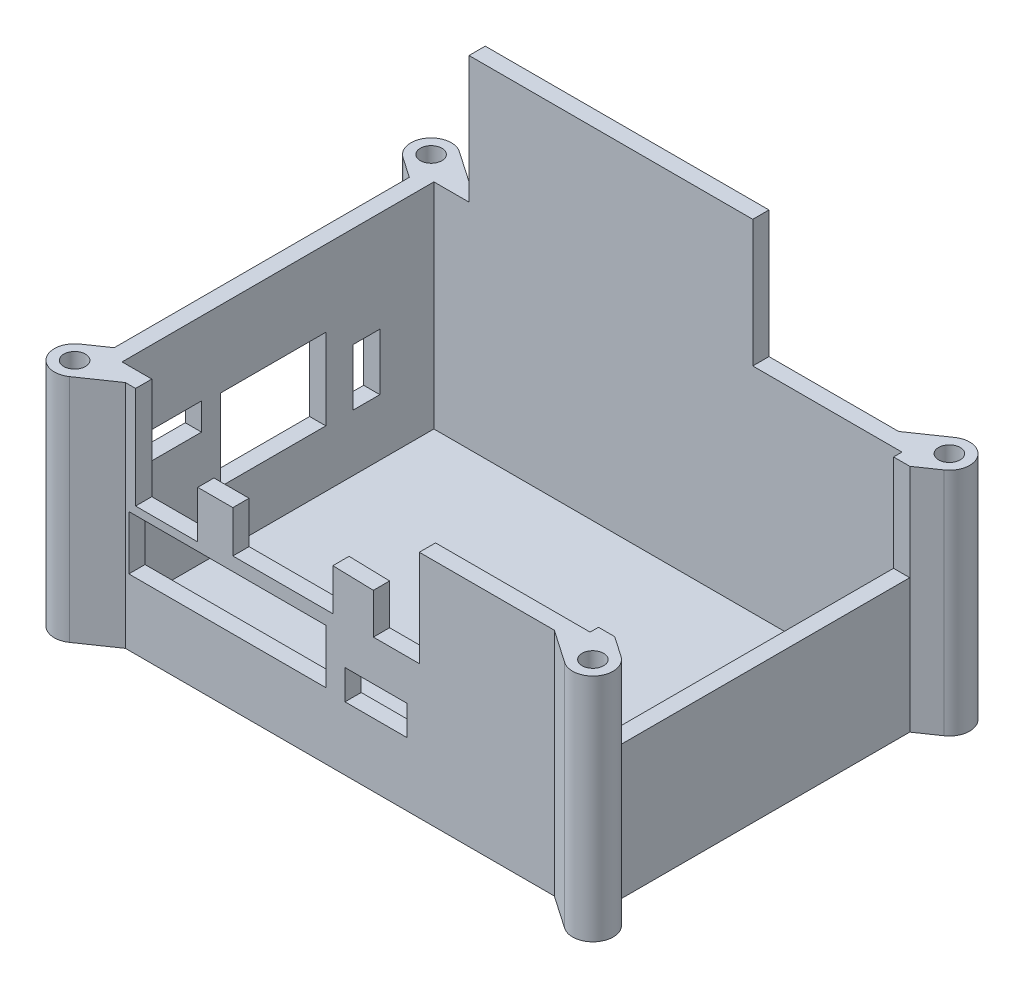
ISO-10303-21;
HEADER;
FILE_DESCRIPTION(('STEP AP214'),'2;1');
FILE_NAME('part.step','',(''),(''),'','','');
FILE_SCHEMA(('AUTOMOTIVE_DESIGN { 1 0 10303 214 1 1 1 1 }'));
ENDSEC;
DATA;
#1=APPLICATION_CONTEXT('core data for automotive mechanical design processes');
#2=APPLICATION_PROTOCOL_DEFINITION('international standard','automotive_design',2000,#1);
#3=PRODUCT_CONTEXT('',#1,'mechanical');
#4=PRODUCT('Part','Part','',(#3));
#5=PRODUCT_RELATED_PRODUCT_CATEGORY('part','',(#4));
#6=PRODUCT_DEFINITION_FORMATION('','',#4);
#7=PRODUCT_DEFINITION_CONTEXT('part definition',#1,'design');
#8=PRODUCT_DEFINITION('design','',#6,#7);
#9=PRODUCT_DEFINITION_SHAPE('','',#8);
#10=(LENGTH_UNIT() NAMED_UNIT(*) SI_UNIT(.MILLI.,.METRE.));
#11=(NAMED_UNIT(*) PLANE_ANGLE_UNIT() SI_UNIT($,.RADIAN.));
#12=(NAMED_UNIT(*) SI_UNIT($,.STERADIAN.) SOLID_ANGLE_UNIT());
#13=UNCERTAINTY_MEASURE_WITH_UNIT(LENGTH_MEASURE(1.E-05),#10,'distance_accuracy_value','');
#14=(GEOMETRIC_REPRESENTATION_CONTEXT(3) GLOBAL_UNCERTAINTY_ASSIGNED_CONTEXT((#13)) GLOBAL_UNIT_ASSIGNED_CONTEXT((#10,
#11,#12)) REPRESENTATION_CONTEXT('',''));
#15=CARTESIAN_POINT('',(0.,0.,0.));
#16=DIRECTION('',(0.,0.,1.));
#17=DIRECTION('',(1.,0.,0.));
#18=AXIS2_PLACEMENT_3D('',#15,#16,#17);
#19=CARTESIAN_POINT('',(-94.2477722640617,42.6,1.13351072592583));
#20=DIRECTION('',(0.,1.,0.));
#21=DIRECTION('',(0.,0.,1.));
#22=AXIS2_PLACEMENT_3D('',#19,#20,#21);
#23=PLANE('',#22);
#24=DIRECTION('',(0.,0.,-1.));
#25=VECTOR('',#24,1.);
#26=CARTESIAN_POINT('',(-30.6,42.6,-60.7));
#27=LINE('',#26,#25);
#28=CARTESIAN_POINT('',(-30.6,42.6,-60.7));
#29=VERTEX_POINT('',#28);
#30=CARTESIAN_POINT('',(-30.6,42.6,-63.7));
#31=VERTEX_POINT('',#30);
#32=EDGE_CURVE('E816',#29,#31,#27,.T.);
#33=ORIENTED_EDGE('',*,*,#32,.F.);
#34=DIRECTION('',(1.,0.,0.));
#35=VECTOR('',#34,1.);
#36=CARTESIAN_POINT('',(-89.6,42.6,-60.7));
#37=LINE('',#36,#35);
#38=CARTESIAN_POINT('',(-3.,42.6,-60.7));
#39=VERTEX_POINT('',#38);
#40=EDGE_CURVE('E968',#29,#39,#37,.T.);
#41=ORIENTED_EDGE('',*,*,#40,.T.);
#42=DIRECTION('',(0.,0.,1.));
#43=VECTOR('',#42,1.);
#44=CARTESIAN_POINT('',(-3.,42.6,-60.7));
#45=LINE('',#44,#43);
#46=CARTESIAN_POINT('',(-3.,42.6,-59.1484001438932));
#47=VERTEX_POINT('',#46);
#48=EDGE_CURVE('E973',#39,#47,#45,.T.);
#49=ORIENTED_EDGE('',*,*,#48,.T.);
#50=DIRECTION('',(1.,0.,0.));
#51=VECTOR('',#50,1.);
#52=CARTESIAN_POINT('',(-33.6,42.6,-59.1484001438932));
#53=LINE('',#52,#51);
#54=CARTESIAN_POINT('',(0.,42.6,-59.1484001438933));
#55=VERTEX_POINT('',#54);
#56=EDGE_CURVE('E829',#47,#55,#53,.T.);
#57=ORIENTED_EDGE('',*,*,#56,.T.);
#58=DIRECTION('',(-0.823886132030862,0.,0.566755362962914));
#59=VECTOR('',#58,1.);
#60=CARTESIAN_POINT('',(3.77310487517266,42.6,-61.7439377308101));
#61=LINE('',#60,#59);
#62=CARTESIAN_POINT('',(3.77310487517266,42.6,-61.7439377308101));
#63=VERTEX_POINT('',#62);
#64=EDGE_CURVE('E1044',#63,#55,#61,.T.);
#65=ORIENTED_EDGE('',*,*,#64,.F.);
#66=CARTESIAN_POINT('',(1.64777226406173,42.6,-64.8335107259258));
#67=DIRECTION('',(0.,1.,0.));
#68=DIRECTION('',(0.,0.,1.));
#69=AXIS2_PLACEMENT_3D('',#66,#67,#68);
#70=CIRCLE('',#69,3.75);
#71=CARTESIAN_POINT('',(-0.477560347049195,42.6,-67.9230837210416));
#72=VERTEX_POINT('',#71);
#73=EDGE_CURVE('E1047',#63,#72,#70,.T.);
#74=ORIENTED_EDGE('',*,*,#73,.T.);
#75=DIRECTION('',(-0.823886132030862,0.,0.566755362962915));
#76=VECTOR('',#75,1.);
#77=CARTESIAN_POINT('',(-0.477560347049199,42.6,-67.9230837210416));
#78=LINE('',#77,#76);
#79=CARTESIAN_POINT('',(-6.61661140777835,42.6,-63.7));
#80=VERTEX_POINT('',#79);
#81=EDGE_CURVE('E1049',#72,#80,#78,.T.);
#82=ORIENTED_EDGE('',*,*,#81,.T.);
#83=DIRECTION('',(1.,0.,0.));
#84=VECTOR('',#83,1.);
#85=CARTESIAN_POINT('',(-85.9833885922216,42.6,-63.7));
#86=LINE('',#85,#84);
#87=EDGE_CURVE('E1052',#31,#80,#86,.T.);
#88=ORIENTED_EDGE('',*,*,#87,.F.);
#89=EDGE_LOOP('',(#33,#41,#49,#57,#65,#74,#82,#88));
#90=FACE_BOUND('',#89,.T.);
#91=CARTESIAN_POINT('',(1.64777226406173,42.6,-64.8335107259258));
#92=DIRECTION('',(0.,1.,0.));
#93=DIRECTION('',(0.,0.,1.));
#94=AXIS2_PLACEMENT_3D('',#91,#92,#93);
#95=CIRCLE('',#94,2.);
#96=CARTESIAN_POINT('',(1.64777226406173,42.6,-62.8335107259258));
#97=VERTEX_POINT('',#96);
#98=EDGE_CURVE('E1007',#97,#97,#95,.T.);
#99=ORIENTED_EDGE('',*,*,#98,.F.);
#100=EDGE_LOOP('',(#99));
#101=FACE_BOUND('',#100,.T.);
#102=ADVANCED_FACE('F310',(#90,#101),#23,.T.);
#103=DIRECTION('',(1.,0.,0.));
#104=VECTOR('',#103,1.);
#105=CARTESIAN_POINT('',(-33.6,42.6,-4.55159985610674));
#106=LINE('',#105,#104);
#107=CARTESIAN_POINT('',(-3.,42.6,-4.55159985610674));
#108=VERTEX_POINT('',#107);
#109=CARTESIAN_POINT('',(0.,42.6,-4.55159985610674));
#110=VERTEX_POINT('',#109);
#111=EDGE_CURVE('E826',#108,#110,#106,.T.);
#112=ORIENTED_EDGE('',*,*,#111,.F.);
#113=CARTESIAN_POINT('',(-3.,42.6,-3.));
#114=VERTEX_POINT('',#113);
#115=EDGE_CURVE('E972',#108,#114,#45,.T.);
#116=ORIENTED_EDGE('',*,*,#115,.T.);
#117=DIRECTION('',(1.,0.,0.));
#118=VECTOR('',#117,1.);
#119=CARTESIAN_POINT('',(-89.6,42.6,-3.));
#120=LINE('',#119,#118);
#121=CARTESIAN_POINT('',(-31.6,42.6,-3.));
#122=VERTEX_POINT('',#121);
#123=EDGE_CURVE('E976',#122,#114,#120,.T.);
#124=ORIENTED_EDGE('',*,*,#123,.F.);
#125=DIRECTION('',(0.,0.,1.));
#126=VECTOR('',#125,1.);
#127=CARTESIAN_POINT('',(-31.6,42.6,-33.6));
#128=LINE('',#127,#126);
#129=CARTESIAN_POINT('',(-31.6,42.6,0.));
#130=VERTEX_POINT('',#129);
#131=EDGE_CURVE('E869',#122,#130,#128,.T.);
#132=ORIENTED_EDGE('',*,*,#131,.T.);
#133=DIRECTION('',(1.,0.,0.));
#134=VECTOR('',#133,1.);
#135=CARTESIAN_POINT('',(-85.9833885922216,42.6,0.));
#136=LINE('',#135,#134);
#137=CARTESIAN_POINT('',(-6.61661140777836,42.6,0.));
#138=VERTEX_POINT('',#137);
#139=EDGE_CURVE('E1032',#130,#138,#136,.T.);
#140=ORIENTED_EDGE('',*,*,#139,.T.);
#141=DIRECTION('',(-0.823886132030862,0.,-0.566755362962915));
#142=VECTOR('',#141,1.);
#143=CARTESIAN_POINT('',(-0.477560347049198,42.6,4.22308372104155));
#144=LINE('',#143,#142);
#145=CARTESIAN_POINT('',(-0.477560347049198,42.6,4.22308372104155));
#146=VERTEX_POINT('',#145);
#147=EDGE_CURVE('E1036',#146,#138,#144,.T.);
#148=ORIENTED_EDGE('',*,*,#147,.F.);
#149=CARTESIAN_POINT('',(1.64777226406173,42.6,1.13351072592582));
#150=DIRECTION('',(0.,1.,0.));
#151=DIRECTION('',(0.,0.,1.));
#152=AXIS2_PLACEMENT_3D('',#149,#150,#151);
#153=CIRCLE('',#152,3.75);
#154=CARTESIAN_POINT('',(3.77310487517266,42.6,-1.95606226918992));
#155=VERTEX_POINT('',#154);
#156=EDGE_CURVE('E1039',#146,#155,#153,.T.);
#157=ORIENTED_EDGE('',*,*,#156,.T.);
#158=DIRECTION('',(-0.823886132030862,0.,-0.566755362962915));
#159=VECTOR('',#158,1.);
#160=CARTESIAN_POINT('',(3.77310487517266,42.6,-1.95606226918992));
#161=LINE('',#160,#159);
#162=EDGE_CURVE('E1041',#155,#110,#161,.T.);
#163=ORIENTED_EDGE('',*,*,#162,.T.);
#164=EDGE_LOOP('',(#112,#116,#124,#132,#140,#148,#157,#163));
#165=FACE_BOUND('',#164,.T.);
#166=CARTESIAN_POINT('',(1.64777226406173,42.6,1.13351072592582));
#167=DIRECTION('',(0.,1.,0.));
#168=DIRECTION('',(0.,0.,1.));
#169=AXIS2_PLACEMENT_3D('',#166,#167,#168);
#170=CIRCLE('',#169,2.);
#171=CARTESIAN_POINT('',(1.64777226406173,42.6,3.13351072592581));
#172=VERTEX_POINT('',#171);
#173=EDGE_CURVE('E1013',#172,#172,#170,.T.);
#174=ORIENTED_EDGE('',*,*,#173,.F.);
#175=EDGE_LOOP('',(#174));
#176=FACE_BOUND('',#175,.T.);
#177=ADVANCED_FACE('F1229',(#165,#176),#23,.T.);
#178=CARTESIAN_POINT('',(-89.6,42.6,-3.));
#179=DIRECTION('',(0.,0.,-1.));
#180=DIRECTION('',(-1.,0.,0.));
#181=AXIS2_PLACEMENT_3D('',#178,#179,#180);
#182=PLANE('',#181);
#183=DIRECTION('',(0.,-1.,0.));
#184=VECTOR('',#183,1.);
#185=CARTESIAN_POINT('',(-72.6,42.6,-3.));
#186=LINE('',#185,#184);
#187=CARTESIAN_POINT('',(-72.6,32.5,-3.));
#188=VERTEX_POINT('',#187);
#189=CARTESIAN_POINT('',(-72.6,23.75,-3.));
#190=VERTEX_POINT('',#189);
#191=EDGE_CURVE('E741',#188,#190,#186,.T.);
#192=ORIENTED_EDGE('',*,*,#191,.F.);
#193=DIRECTION('',(-1.,0.,0.));
#194=VECTOR('',#193,1.);
#195=CARTESIAN_POINT('',(-89.6,32.5,-3.));
#196=LINE('',#195,#194);
#197=CARTESIAN_POINT('',(-66.1,32.5,-3.));
#198=VERTEX_POINT('',#197);
#199=EDGE_CURVE('E913',#198,#188,#196,.T.);
#200=ORIENTED_EDGE('',*,*,#199,.F.);
#201=DIRECTION('',(0.,-1.,0.));
#202=VECTOR('',#201,1.);
#203=CARTESIAN_POINT('',(-66.1,42.6,-3.));
#204=LINE('',#203,#202);
#205=CARTESIAN_POINT('',(-66.1,24.75,-3.));
#206=VERTEX_POINT('',#205);
#207=EDGE_CURVE('E896',#198,#206,#204,.T.);
#208=ORIENTED_EDGE('',*,*,#207,.T.);
#209=DIRECTION('',(-1.,0.,0.));
#210=VECTOR('',#209,1.);
#211=CARTESIAN_POINT('',(-89.6,24.75,-3.));
#212=LINE('',#211,#210);
#213=CARTESIAN_POINT('',(-47.6,24.75,-3.));
#214=VERTEX_POINT('',#213);
#215=EDGE_CURVE('E899',#214,#206,#212,.T.);
#216=ORIENTED_EDGE('',*,*,#215,.F.);
#217=DIRECTION('',(0.,-1.,0.));
#218=VECTOR('',#217,1.);
#219=CARTESIAN_POINT('',(-47.6,42.6,-3.));
#220=LINE('',#219,#218);
#221=CARTESIAN_POINT('',(-47.6,32.4473684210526,-3.));
#222=VERTEX_POINT('',#221);
#223=EDGE_CURVE('E753',#222,#214,#220,.T.);
#224=ORIENTED_EDGE('',*,*,#223,.F.);
#225=DIRECTION('',(-0.999653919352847,0.0263066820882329,0.));
#226=VECTOR('',#225,1.);
#227=CARTESIAN_POINT('',(-89.8379238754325,33.558892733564,-3.));
#228=LINE('',#227,#226);
#229=CARTESIAN_POINT('',(-40.1,32.25,-3.));
#230=VERTEX_POINT('',#229);
#231=EDGE_CURVE('E901',#230,#222,#228,.T.);
#232=ORIENTED_EDGE('',*,*,#231,.F.);
#233=DIRECTION('',(0.,-1.,0.));
#234=VECTOR('',#233,1.);
#235=CARTESIAN_POINT('',(-40.1,42.6,-3.));
#236=LINE('',#235,#234);
#237=CARTESIAN_POINT('',(-40.1,24.75,-3.));
#238=VERTEX_POINT('',#237);
#239=EDGE_CURVE('E904',#230,#238,#236,.T.);
#240=ORIENTED_EDGE('',*,*,#239,.T.);
#241=DIRECTION('',(-1.,0.,0.));
#242=VECTOR('',#241,1.);
#243=CARTESIAN_POINT('',(-89.6,24.75,-3.));
#244=LINE('',#243,#242);
#245=CARTESIAN_POINT('',(-31.6,24.75,-3.));
#246=VERTEX_POINT('',#245);
#247=EDGE_CURVE('E907',#246,#238,#244,.T.);
#248=ORIENTED_EDGE('',*,*,#247,.F.);
#249=DIRECTION('',(0.,-1.,0.));
#250=VECTOR('',#249,1.);
#251=CARTESIAN_POINT('',(-31.6,42.6,-3.));
#252=LINE('',#251,#250);
#253=EDGE_CURVE('E909',#122,#246,#252,.T.);
#254=ORIENTED_EDGE('',*,*,#253,.F.);
#255=ORIENTED_EDGE('',*,*,#123,.T.);
#256=DIRECTION('',(0.,-1.,0.));
#257=VECTOR('',#256,1.);
#258=CARTESIAN_POINT('',(-3.,42.6,-3.));
#259=LINE('',#258,#257);
#260=CARTESIAN_POINT('',(-3.,3.,-3.));
#261=VERTEX_POINT('',#260);
#262=EDGE_CURVE('E990',#114,#261,#259,.T.);
#263=ORIENTED_EDGE('',*,*,#262,.T.);
#264=DIRECTION('',(1.,0.,0.));
#265=VECTOR('',#264,1.);
#266=CARTESIAN_POINT('',(-89.6,3.,-3.));
#267=LINE('',#266,#265);
#268=CARTESIAN_POINT('',(-89.6,3.,-3.));
#269=VERTEX_POINT('',#268);
#270=EDGE_CURVE('E1144',#269,#261,#267,.T.);
#271=ORIENTED_EDGE('',*,*,#270,.F.);
#272=DIRECTION('',(0.,-1.,0.));
#273=VECTOR('',#272,1.);
#274=CARTESIAN_POINT('',(-89.6,42.6,-3.));
#275=LINE('',#274,#273);
#276=CARTESIAN_POINT('',(-89.6,42.6,-3.));
#277=VERTEX_POINT('',#276);
#278=EDGE_CURVE('E987',#277,#269,#275,.T.);
#279=ORIENTED_EDGE('',*,*,#278,.F.);
#280=CARTESIAN_POINT('',(-84.1,42.6,-3.));
#281=VERTEX_POINT('',#280);
#282=EDGE_CURVE('E977',#277,#281,#120,.T.);
#283=ORIENTED_EDGE('',*,*,#282,.T.);
#284=DIRECTION('',(0.,-1.,0.));
#285=VECTOR('',#284,1.);
#286=CARTESIAN_POINT('',(-84.1,42.6,-3.));
#287=LINE('',#286,#285);
#288=CARTESIAN_POINT('',(-84.1,23.75,-3.));
#289=VERTEX_POINT('',#288);
#290=EDGE_CURVE('E911',#281,#289,#287,.T.);
#291=ORIENTED_EDGE('',*,*,#290,.T.);
#292=DIRECTION('',(-1.,0.,0.));
#293=VECTOR('',#292,1.);
#294=CARTESIAN_POINT('',(-89.6,23.75,-3.));
#295=LINE('',#294,#293);
#296=EDGE_CURVE('E745',#190,#289,#295,.T.);
#297=ORIENTED_EDGE('',*,*,#296,.F.);
#298=EDGE_LOOP('',(#192,#200,#208,#216,#224,#232,#240,#248,#254,#255,#263,#271,#279,#283,#291,#297));
#299=FACE_BOUND('',#298,.T.);
#300=DIRECTION('',(0.,-1.,0.));
#301=VECTOR('',#300,1.);
#302=CARTESIAN_POINT('',(-45.35,42.6,-3.));
#303=LINE('',#302,#301);
#304=CARTESIAN_POINT('',(-45.35,17.25,-3.));
#305=VERTEX_POINT('',#304);
#306=CARTESIAN_POINT('',(-45.35,11.75,-3.));
#307=VERTEX_POINT('',#306);
#308=EDGE_CURVE('E894',#305,#307,#303,.T.);
#309=ORIENTED_EDGE('',*,*,#308,.T.);
#310=DIRECTION('',(-1.,0.,0.));
#311=VECTOR('',#310,1.);
#312=CARTESIAN_POINT('',(-89.6,11.75,-3.));
#313=LINE('',#312,#311);
#314=CARTESIAN_POINT('',(-33.85,11.75,-3.));
#315=VERTEX_POINT('',#314);
#316=EDGE_CURVE('E766',#315,#307,#313,.T.);
#317=ORIENTED_EDGE('',*,*,#316,.F.);
#318=DIRECTION('',(0.,-1.,0.));
#319=VECTOR('',#318,1.);
#320=CARTESIAN_POINT('',(-33.85,42.6,-3.));
#321=LINE('',#320,#319);
#322=CARTESIAN_POINT('',(-33.85,17.25,-3.));
#323=VERTEX_POINT('',#322);
#324=EDGE_CURVE('E773',#323,#315,#321,.T.);
#325=ORIENTED_EDGE('',*,*,#324,.F.);
#326=DIRECTION('',(-1.,0.,0.));
#327=VECTOR('',#326,1.);
#328=CARTESIAN_POINT('',(-89.6,17.25,-3.));
#329=LINE('',#328,#327);
#330=EDGE_CURVE('E891',#323,#305,#329,.T.);
#331=ORIENTED_EDGE('',*,*,#330,.T.);
#332=EDGE_LOOP('',(#309,#317,#325,#331));
#333=FACE_BOUND('',#332,.T.);
#334=DIRECTION('',(0.,1.,0.));
#335=VECTOR('',#334,1.);
#336=CARTESIAN_POINT('',(-85.35,42.6,-3.));
#337=LINE('',#336,#335);
#338=CARTESIAN_POINT('',(-85.35,12.25,-3.));
#339=VERTEX_POINT('',#338);
#340=CARTESIAN_POINT('',(-85.35,22.25,-3.));
#341=VERTEX_POINT('',#340);
#342=EDGE_CURVE('E868',#339,#341,#337,.T.);
#343=ORIENTED_EDGE('',*,*,#342,.F.);
#344=DIRECTION('',(-1.,0.,0.));
#345=VECTOR('',#344,1.);
#346=CARTESIAN_POINT('',(-89.6,12.25,-3.));
#347=LINE('',#346,#345);
#348=CARTESIAN_POINT('',(-48.85,12.25,-3.));
#349=VERTEX_POINT('',#348);
#350=EDGE_CURVE('E788',#349,#339,#347,.T.);
#351=ORIENTED_EDGE('',*,*,#350,.F.);
#352=DIRECTION('',(0.,-1.,0.));
#353=VECTOR('',#352,1.);
#354=CARTESIAN_POINT('',(-48.85,42.6,-3.));
#355=LINE('',#354,#353);
#356=CARTESIAN_POINT('',(-48.85,22.25,-3.));
#357=VERTEX_POINT('',#356);
#358=EDGE_CURVE('E797',#357,#349,#355,.T.);
#359=ORIENTED_EDGE('',*,*,#358,.F.);
#360=DIRECTION('',(1.,0.,0.));
#361=VECTOR('',#360,1.);
#362=CARTESIAN_POINT('',(-89.6,22.25,-3.));
#363=LINE('',#362,#361);
#364=EDGE_CURVE('E799',#341,#357,#363,.T.);
#365=ORIENTED_EDGE('',*,*,#364,.F.);
#366=EDGE_LOOP('',(#343,#351,#359,#365));
#367=FACE_BOUND('',#366,.T.);
#368=ADVANCED_FACE('F1174',(#299,#333,#367),#182,.T.);
#369=DIRECTION('',(0.,0.,-1.));
#370=VECTOR('',#369,1.);
#371=CARTESIAN_POINT('',(-83.1,42.6,-60.7));
#372=LINE('',#371,#370);
#373=CARTESIAN_POINT('',(-83.1,42.6,-60.7));
#374=VERTEX_POINT('',#373);
#375=CARTESIAN_POINT('',(-83.1,42.6,-63.7));
#376=VERTEX_POINT('',#375);
#377=EDGE_CURVE('E810',#374,#376,#372,.T.);
#378=ORIENTED_EDGE('',*,*,#377,.T.);
#379=CARTESIAN_POINT('',(-85.9833885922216,42.6,-63.7));
#380=VERTEX_POINT('',#379);
#381=EDGE_CURVE('E1053',#380,#376,#86,.T.);
#382=ORIENTED_EDGE('',*,*,#381,.F.);
#383=DIRECTION('',(0.823886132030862,0.,0.566755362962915));
#384=VECTOR('',#383,1.);
#385=CARTESIAN_POINT('',(-92.1224396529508,42.6,-67.9230837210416));
#386=LINE('',#385,#384);
#387=CARTESIAN_POINT('',(-92.1224396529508,42.6,-67.9230837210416));
#388=VERTEX_POINT('',#387);
#389=EDGE_CURVE('E1056',#388,#380,#386,.T.);
#390=ORIENTED_EDGE('',*,*,#389,.F.);
#391=CARTESIAN_POINT('',(-94.2477722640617,42.6,-64.8335107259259));
#392=DIRECTION('',(0.,1.,0.));
#393=DIRECTION('',(0.,0.,1.));
#394=AXIS2_PLACEMENT_3D('',#391,#392,#393);
#395=CIRCLE('',#394,3.75);
#396=CARTESIAN_POINT('',(-96.3731048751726,42.6,-61.7439377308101));
#397=VERTEX_POINT('',#396);
#398=EDGE_CURVE('E1059',#388,#397,#395,.T.);
#399=ORIENTED_EDGE('',*,*,#398,.T.);
#400=DIRECTION('',(0.823886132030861,0.,0.566755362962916));
#401=VECTOR('',#400,1.);
#402=CARTESIAN_POINT('',(-96.3731048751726,42.6,-61.7439377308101));
#403=LINE('',#402,#401);
#404=CARTESIAN_POINT('',(-92.6,42.6,-59.1484001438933));
#405=VERTEX_POINT('',#404);
#406=EDGE_CURVE('E1019',#397,#405,#403,.T.);
#407=ORIENTED_EDGE('',*,*,#406,.T.);
#408=DIRECTION('',(0.,0.,1.));
#409=VECTOR('',#408,1.);
#410=CARTESIAN_POINT('',(-92.6,42.6,-59.1484001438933));
#411=LINE('',#410,#409);
#412=CARTESIAN_POINT('',(-92.6,42.6,-4.55159985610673));
#413=VERTEX_POINT('',#412);
#414=EDGE_CURVE('E1022',#405,#413,#411,.T.);
#415=ORIENTED_EDGE('',*,*,#414,.T.);
#416=DIRECTION('',(0.823886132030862,0.,-0.566755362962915));
#417=VECTOR('',#416,1.);
#418=CARTESIAN_POINT('',(-96.3731048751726,42.6,-1.95606226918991));
#419=LINE('',#418,#417);
#420=CARTESIAN_POINT('',(-96.3731048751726,42.6,-1.95606226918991));
#421=VERTEX_POINT('',#420);
#422=EDGE_CURVE('E1025',#421,#413,#419,.T.);
#423=ORIENTED_EDGE('',*,*,#422,.F.);
#424=CARTESIAN_POINT('',(-94.2477722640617,42.6,1.13351072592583));
#425=DIRECTION('',(0.,1.,0.));
#426=DIRECTION('',(0.,0.,1.));
#427=AXIS2_PLACEMENT_3D('',#424,#425,#426);
#428=CIRCLE('',#427,3.75);
#429=CARTESIAN_POINT('',(-92.1224396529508,42.6,4.22308372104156));
#430=VERTEX_POINT('',#429);
#431=EDGE_CURVE('E1028',#421,#430,#428,.T.);
#432=ORIENTED_EDGE('',*,*,#431,.T.);
#433=DIRECTION('',(0.823886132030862,0.,-0.566755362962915));
#434=VECTOR('',#433,1.);
#435=CARTESIAN_POINT('',(-92.1224396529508,42.6,4.22308372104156));
#436=LINE('',#435,#434);
#437=CARTESIAN_POINT('',(-85.9833885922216,42.6,0.));
#438=VERTEX_POINT('',#437);
#439=EDGE_CURVE('E1030',#430,#438,#436,.T.);
#440=ORIENTED_EDGE('',*,*,#439,.T.);
#441=CARTESIAN_POINT('',(-84.1,42.6,0.));
#442=VERTEX_POINT('',#441);
#443=EDGE_CURVE('E1033',#438,#442,#136,.T.);
#444=ORIENTED_EDGE('',*,*,#443,.T.);
#445=DIRECTION('',(0.,0.,1.));
#446=VECTOR('',#445,1.);
#447=CARTESIAN_POINT('',(-84.1,42.6,-33.6));
#448=LINE('',#447,#446);
#449=EDGE_CURVE('E866',#281,#442,#448,.T.);
#450=ORIENTED_EDGE('',*,*,#449,.F.);
#451=ORIENTED_EDGE('',*,*,#282,.F.);
#452=DIRECTION('',(0.,0.,1.));
#453=VECTOR('',#452,1.);
#454=CARTESIAN_POINT('',(-89.6,42.6,-60.7));
#455=LINE('',#454,#453);
#456=CARTESIAN_POINT('',(-89.6,42.6,-60.7));
#457=VERTEX_POINT('',#456);
#458=EDGE_CURVE('E980',#457,#277,#455,.T.);
#459=ORIENTED_EDGE('',*,*,#458,.F.);
#460=EDGE_CURVE('E969',#457,#374,#37,.T.);
#461=ORIENTED_EDGE('',*,*,#460,.T.);
#462=EDGE_LOOP('',(#378,#382,#390,#399,#407,#415,#423,#432,#440,#444,#450,#451,#459,#461));
#463=FACE_BOUND('',#462,.T.);
#464=CARTESIAN_POINT('',(-94.2477722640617,42.6,-64.8335107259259));
#465=DIRECTION('',(0.,1.,0.));
#466=DIRECTION('',(0.,0.,1.));
#467=AXIS2_PLACEMENT_3D('',#464,#465,#466);
#468=CIRCLE('',#467,2.);
#469=CARTESIAN_POINT('',(-94.2477722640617,42.6,-62.8335107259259));
#470=VERTEX_POINT('',#469);
#471=EDGE_CURVE('E1001',#470,#470,#468,.T.);
#472=ORIENTED_EDGE('',*,*,#471,.F.);
#473=EDGE_LOOP('',(#472));
#474=FACE_BOUND('',#473,.T.);
#475=CARTESIAN_POINT('',(-94.2477722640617,42.6,1.13351072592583));
#476=DIRECTION('',(0.,1.,0.));
#477=DIRECTION('',(0.,0.,1.));
#478=AXIS2_PLACEMENT_3D('',#475,#476,#477);
#479=CIRCLE('',#478,2.);
#480=CARTESIAN_POINT('',(-94.2477722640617,42.6,3.13351072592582));
#481=VERTEX_POINT('',#480);
#482=EDGE_CURVE('E995',#481,#481,#479,.T.);
#483=ORIENTED_EDGE('',*,*,#482,.F.);
#484=EDGE_LOOP('',(#483));
#485=FACE_BOUND('',#484,.T.);
#486=ADVANCED_FACE('F1202',(#463,#474,#485),#23,.T.);
#487=CARTESIAN_POINT('',(-85.9833885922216,42.6,0.));
#488=DIRECTION('',(0.,0.,-1.));
#489=DIRECTION('',(-1.,0.,0.));
#490=AXIS2_PLACEMENT_3D('',#487,#488,#489);
#491=PLANE('',#490);
#492=DIRECTION('',(1.,0.,0.));
#493=VECTOR('',#492,1.);
#494=CARTESIAN_POINT('',(-85.35,12.25,0.));
#495=LINE('',#494,#493);
#496=CARTESIAN_POINT('',(-85.35,12.25,0.));
#497=VERTEX_POINT('',#496);
#498=CARTESIAN_POINT('',(-48.85,12.25,0.));
#499=VERTEX_POINT('',#498);
#500=EDGE_CURVE('E775',#497,#499,#495,.T.);
#501=ORIENTED_EDGE('',*,*,#500,.F.);
#502=DIRECTION('',(0.,-1.,0.));
#503=VECTOR('',#502,1.);
#504=CARTESIAN_POINT('',(-85.35,0.,0.));
#505=LINE('',#504,#503);
#506=CARTESIAN_POINT('',(-85.35,22.25,0.));
#507=VERTEX_POINT('',#506);
#508=EDGE_CURVE('E843',#507,#497,#505,.T.);
#509=ORIENTED_EDGE('',*,*,#508,.F.);
#510=DIRECTION('',(-1.,0.,0.));
#511=VECTOR('',#510,1.);
#512=CARTESIAN_POINT('',(-85.35,22.25,0.));
#513=LINE('',#512,#511);
#514=CARTESIAN_POINT('',(-48.85,22.25,0.));
#515=VERTEX_POINT('',#514);
#516=EDGE_CURVE('E781',#515,#507,#513,.T.);
#517=ORIENTED_EDGE('',*,*,#516,.F.);
#518=DIRECTION('',(0.,1.,0.));
#519=VECTOR('',#518,1.);
#520=CARTESIAN_POINT('',(-48.85,22.25,0.));
#521=LINE('',#520,#519);
#522=EDGE_CURVE('E778',#499,#515,#521,.T.);
#523=ORIENTED_EDGE('',*,*,#522,.F.);
#524=EDGE_LOOP('',(#501,#509,#517,#523));
#525=FACE_BOUND('',#524,.T.);
#526=DIRECTION('',(1.,0.,0.));
#527=VECTOR('',#526,1.);
#528=CARTESIAN_POINT('',(-45.35,11.75,0.));
#529=LINE('',#528,#527);
#530=CARTESIAN_POINT('',(-45.35,11.75,0.));
#531=VERTEX_POINT('',#530);
#532=CARTESIAN_POINT('',(-33.85,11.75,0.));
#533=VERTEX_POINT('',#532);
#534=EDGE_CURVE('E756',#531,#533,#529,.T.);
#535=ORIENTED_EDGE('',*,*,#534,.F.);
#536=DIRECTION('',(0.,1.,0.));
#537=VECTOR('',#536,1.);
#538=CARTESIAN_POINT('',(-45.35,0.,0.));
#539=LINE('',#538,#537);
#540=CARTESIAN_POINT('',(-45.35,17.25,0.));
#541=VERTEX_POINT('',#540);
#542=EDGE_CURVE('E885',#531,#541,#539,.T.);
#543=ORIENTED_EDGE('',*,*,#542,.T.);
#544=DIRECTION('',(1.,0.,0.));
#545=VECTOR('',#544,1.);
#546=CARTESIAN_POINT('',(0.,17.25,0.));
#547=LINE('',#546,#545);
#548=CARTESIAN_POINT('',(-33.85,17.25,0.));
#549=VERTEX_POINT('',#548);
#550=EDGE_CURVE('E883',#541,#549,#547,.T.);
#551=ORIENTED_EDGE('',*,*,#550,.T.);
#552=DIRECTION('',(0.,1.,0.));
#553=VECTOR('',#552,1.);
#554=CARTESIAN_POINT('',(-33.85,17.25,0.));
#555=LINE('',#554,#553);
#556=EDGE_CURVE('E759',#533,#549,#555,.T.);
#557=ORIENTED_EDGE('',*,*,#556,.F.);
#558=EDGE_LOOP('',(#535,#543,#551,#557));
#559=FACE_BOUND('',#558,.T.);
#560=DIRECTION('',(1.,0.,0.));
#561=VECTOR('',#560,1.);
#562=CARTESIAN_POINT('',(0.,32.5,0.));
#563=LINE('',#562,#561);
#564=CARTESIAN_POINT('',(-72.6,32.5,0.));
#565=VERTEX_POINT('',#564);
#566=CARTESIAN_POINT('',(-66.1,32.5,0.));
#567=VERTEX_POINT('',#566);
#568=EDGE_CURVE('E844',#565,#567,#563,.T.);
#569=ORIENTED_EDGE('',*,*,#568,.F.);
#570=DIRECTION('',(0.,1.,0.));
#571=VECTOR('',#570,1.);
#572=CARTESIAN_POINT('',(-72.6,23.75,0.));
#573=LINE('',#572,#571);
#574=CARTESIAN_POINT('',(-72.6,23.75,0.));
#575=VERTEX_POINT('',#574);
#576=EDGE_CURVE('E736',#575,#565,#573,.T.);
#577=ORIENTED_EDGE('',*,*,#576,.F.);
#578=DIRECTION('',(1.,0.,0.));
#579=VECTOR('',#578,1.);
#580=CARTESIAN_POINT('',(-84.1,23.75,0.));
#581=LINE('',#580,#579);
#582=CARTESIAN_POINT('',(-84.1,23.75,0.));
#583=VERTEX_POINT('',#582);
#584=EDGE_CURVE('E733',#583,#575,#581,.T.);
#585=ORIENTED_EDGE('',*,*,#584,.F.);
#586=DIRECTION('',(0.,1.,0.));
#587=VECTOR('',#586,1.);
#588=CARTESIAN_POINT('',(-84.1,0.,0.));
#589=LINE('',#588,#587);
#590=EDGE_CURVE('E862',#583,#442,#589,.T.);
#591=ORIENTED_EDGE('',*,*,#590,.T.);
#592=ORIENTED_EDGE('',*,*,#443,.F.);
#593=DIRECTION('',(0.,-1.,0.));
#594=VECTOR('',#593,1.);
#595=CARTESIAN_POINT('',(-85.9833885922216,42.6,0.));
#596=LINE('',#595,#594);
#597=CARTESIAN_POINT('',(-85.9833885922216,0.,0.));
#598=VERTEX_POINT('',#597);
#599=EDGE_CURVE('E1131',#438,#598,#596,.T.);
#600=ORIENTED_EDGE('',*,*,#599,.T.);
#601=DIRECTION('',(1.,0.,0.));
#602=VECTOR('',#601,1.);
#603=CARTESIAN_POINT('',(-85.9833885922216,0.,0.));
#604=LINE('',#603,#602);
#605=CARTESIAN_POINT('',(-6.61661140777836,0.,0.));
#606=VERTEX_POINT('',#605);
#607=EDGE_CURVE('E1074',#598,#606,#604,.T.);
#608=ORIENTED_EDGE('',*,*,#607,.T.);
#609=DIRECTION('',(0.,-1.,0.));
#610=VECTOR('',#609,1.);
#611=CARTESIAN_POINT('',(-6.61661140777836,42.6,0.));
#612=LINE('',#611,#610);
#613=EDGE_CURVE('E1129',#138,#606,#612,.T.);
#614=ORIENTED_EDGE('',*,*,#613,.F.);
#615=ORIENTED_EDGE('',*,*,#139,.F.);
#616=DIRECTION('',(0.,1.,0.));
#617=VECTOR('',#616,1.);
#618=CARTESIAN_POINT('',(-31.6,0.,0.));
#619=LINE('',#618,#617);
#620=CARTESIAN_POINT('',(-31.6,24.75,0.));
#621=VERTEX_POINT('',#620);
#622=EDGE_CURVE('E860',#621,#130,#619,.T.);
#623=ORIENTED_EDGE('',*,*,#622,.F.);
#624=DIRECTION('',(1.,0.,0.));
#625=VECTOR('',#624,1.);
#626=CARTESIAN_POINT('',(0.,24.75,0.));
#627=LINE('',#626,#625);
#628=CARTESIAN_POINT('',(-40.1,24.75,0.));
#629=VERTEX_POINT('',#628);
#630=EDGE_CURVE('E857',#629,#621,#627,.T.);
#631=ORIENTED_EDGE('',*,*,#630,.F.);
#632=DIRECTION('',(0.,1.,0.));
#633=VECTOR('',#632,1.);
#634=CARTESIAN_POINT('',(-40.1,0.,0.));
#635=LINE('',#634,#633);
#636=CARTESIAN_POINT('',(-40.1,32.25,0.));
#637=VERTEX_POINT('',#636);
#638=EDGE_CURVE('E854',#629,#637,#635,.T.);
#639=ORIENTED_EDGE('',*,*,#638,.T.);
#640=DIRECTION('',(0.999653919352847,-0.0263066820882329,0.));
#641=VECTOR('',#640,1.);
#642=CARTESIAN_POINT('',(0.820346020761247,31.1731487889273,0.));
#643=LINE('',#642,#641);
#644=CARTESIAN_POINT('',(-47.6,32.4473684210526,0.));
#645=VERTEX_POINT('',#644);
#646=EDGE_CURVE('E852',#645,#637,#643,.T.);
#647=ORIENTED_EDGE('',*,*,#646,.F.);
#648=DIRECTION('',(0.,1.,0.));
#649=VECTOR('',#648,1.);
#650=CARTESIAN_POINT('',(-47.6,24.75,0.));
#651=LINE('',#650,#649);
#652=CARTESIAN_POINT('',(-47.6,24.75,0.));
#653=VERTEX_POINT('',#652);
#654=EDGE_CURVE('E748',#653,#645,#651,.T.);
#655=ORIENTED_EDGE('',*,*,#654,.F.);
#656=DIRECTION('',(1.,0.,0.));
#657=VECTOR('',#656,1.);
#658=CARTESIAN_POINT('',(0.,24.75,0.));
#659=LINE('',#658,#657);
#660=CARTESIAN_POINT('',(-66.1,24.75,0.));
#661=VERTEX_POINT('',#660);
#662=EDGE_CURVE('E850',#661,#653,#659,.T.);
#663=ORIENTED_EDGE('',*,*,#662,.F.);
#664=DIRECTION('',(0.,1.,0.));
#665=VECTOR('',#664,1.);
#666=CARTESIAN_POINT('',(-66.1,0.,0.));
#667=LINE('',#666,#665);
#668=EDGE_CURVE('E846',#661,#567,#667,.T.);
#669=ORIENTED_EDGE('',*,*,#668,.T.);
#670=EDGE_LOOP('',(#569,#577,#585,#591,#592,#600,#608,#614,#615,#623,#631,#639,#647,#655,#663,#669));
#671=FACE_BOUND('',#670,.T.);
#672=ADVANCED_FACE('F1164',(#525,#559,#671),#491,.F.);
#673=CARTESIAN_POINT('',(0.,3.,0.));
#674=DIRECTION('',(0.,-1.,0.));
#675=DIRECTION('',(0.,0.,-1.));
#676=AXIS2_PLACEMENT_3D('',#673,#674,#675);
#677=PLANE('',#676);
#678=ORIENTED_EDGE('',*,*,#270,.T.);
#679=DIRECTION('',(0.,0.,1.));
#680=VECTOR('',#679,1.);
#681=CARTESIAN_POINT('',(-3.,3.,-60.7));
#682=LINE('',#681,#680);
#683=CARTESIAN_POINT('',(-3.,3.,-60.7));
#684=VERTEX_POINT('',#683);
#685=EDGE_CURVE('E1146',#684,#261,#682,.T.);
#686=ORIENTED_EDGE('',*,*,#685,.F.);
#687=DIRECTION('',(1.,0.,0.));
#688=VECTOR('',#687,1.);
#689=CARTESIAN_POINT('',(-89.6,3.,-60.7));
#690=LINE('',#689,#688);
#691=CARTESIAN_POINT('',(-89.6,3.,-60.7));
#692=VERTEX_POINT('',#691);
#693=EDGE_CURVE('E1149',#692,#684,#690,.T.);
#694=ORIENTED_EDGE('',*,*,#693,.F.);
#695=DIRECTION('',(0.,0.,1.));
#696=VECTOR('',#695,1.);
#697=CARTESIAN_POINT('',(-89.6,3.,-60.7));
#698=LINE('',#697,#696);
#699=EDGE_CURVE('E1152',#692,#269,#698,.T.);
#700=ORIENTED_EDGE('',*,*,#699,.T.);
#701=EDGE_LOOP('',(#678,#686,#694,#700));
#702=FACE_BOUND('',#701,.T.);
#703=ADVANCED_FACE('F1264',(#702),#677,.F.);
#704=CARTESIAN_POINT('',(-89.6,42.6,-60.7));
#705=DIRECTION('',(0.,0.,-1.));
#706=DIRECTION('',(-1.,0.,0.));
#707=AXIS2_PLACEMENT_3D('',#704,#705,#706);
#708=PLANE('',#707);
#709=DIRECTION('',(0.,-1.,0.));
#710=VECTOR('',#709,1.);
#711=CARTESIAN_POINT('',(-89.6,42.6,-60.7));
#712=LINE('',#711,#710);
#713=EDGE_CURVE('E983',#457,#692,#712,.T.);
#714=ORIENTED_EDGE('',*,*,#713,.T.);
#715=ORIENTED_EDGE('',*,*,#693,.T.);
#716=DIRECTION('',(0.,-1.,0.));
#717=VECTOR('',#716,1.);
#718=CARTESIAN_POINT('',(-3.,42.6,-60.7));
#719=LINE('',#718,#717);
#720=EDGE_CURVE('E982',#39,#684,#719,.T.);
#721=ORIENTED_EDGE('',*,*,#720,.F.);
#722=ORIENTED_EDGE('',*,*,#40,.F.);
#723=DIRECTION('',(0.,-1.,0.));
#724=VECTOR('',#723,1.);
#725=CARTESIAN_POINT('',(-30.6,66.1,-60.7));
#726=LINE('',#725,#724);
#727=CARTESIAN_POINT('',(-30.6,66.1,-60.7));
#728=VERTEX_POINT('',#727);
#729=EDGE_CURVE('E808',#728,#29,#726,.T.);
#730=ORIENTED_EDGE('',*,*,#729,.F.);
#731=DIRECTION('',(1.,0.,0.));
#732=VECTOR('',#731,1.);
#733=CARTESIAN_POINT('',(-83.1,66.1,-60.7));
#734=LINE('',#733,#732);
#735=CARTESIAN_POINT('',(-83.1,66.1,-60.7));
#736=VERTEX_POINT('',#735);
#737=EDGE_CURVE('E805',#736,#728,#734,.T.);
#738=ORIENTED_EDGE('',*,*,#737,.F.);
#739=DIRECTION('',(0.,1.,0.));
#740=VECTOR('',#739,1.);
#741=CARTESIAN_POINT('',(-83.1,42.6,-60.7));
#742=LINE('',#741,#740);
#743=EDGE_CURVE('E802',#374,#736,#742,.T.);
#744=ORIENTED_EDGE('',*,*,#743,.F.);
#745=ORIENTED_EDGE('',*,*,#460,.F.);
#746=EDGE_LOOP('',(#714,#715,#721,#722,#730,#738,#744,#745));
#747=FACE_BOUND('',#746,.T.);
#748=ADVANCED_FACE('F1279',(#747),#708,.F.);
#749=CARTESIAN_POINT('',(-89.6,42.6,-60.7));
#750=DIRECTION('',(1.,0.,0.));
#751=DIRECTION('',(0.,0.,-1.));
#752=AXIS2_PLACEMENT_3D('',#749,#750,#751);
#753=PLANE('',#752);
#754=DIRECTION('',(0.,-1.,0.));
#755=VECTOR('',#754,1.);
#756=CARTESIAN_POINT('',(-89.6,42.6,-21.2));
#757=LINE('',#756,#755);
#758=CARTESIAN_POINT('',(-89.6,28.5,-21.2));
#759=VERTEX_POINT('',#758);
#760=CARTESIAN_POINT('',(-89.6,13.5,-21.2));
#761=VERTEX_POINT('',#760);
#762=EDGE_CURVE('E703',#759,#761,#757,.T.);
#763=ORIENTED_EDGE('',*,*,#762,.F.);
#764=DIRECTION('',(0.,0.,1.));
#765=VECTOR('',#764,1.);
#766=CARTESIAN_POINT('',(-89.6,28.5,-60.7));
#767=LINE('',#766,#765);
#768=CARTESIAN_POINT('',(-89.6,28.5,-40.7));
#769=VERTEX_POINT('',#768);
#770=EDGE_CURVE('E955',#769,#759,#767,.T.);
#771=ORIENTED_EDGE('',*,*,#770,.F.);
#772=DIRECTION('',(0.,1.,0.));
#773=VECTOR('',#772,1.);
#774=CARTESIAN_POINT('',(-89.6,42.6,-40.7));
#775=LINE('',#774,#773);
#776=CARTESIAN_POINT('',(-89.6,13.5,-40.7));
#777=VERTEX_POINT('',#776);
#778=EDGE_CURVE('E957',#777,#769,#775,.T.);
#779=ORIENTED_EDGE('',*,*,#778,.F.);
#780=DIRECTION('',(0.,0.,-1.));
#781=VECTOR('',#780,1.);
#782=CARTESIAN_POINT('',(-89.6,13.5,-60.7));
#783=LINE('',#782,#781);
#784=EDGE_CURVE('E953',#761,#777,#783,.T.);
#785=ORIENTED_EDGE('',*,*,#784,.F.);
#786=EDGE_LOOP('',(#763,#771,#779,#785));
#787=FACE_BOUND('',#786,.T.);
#788=DIRECTION('',(0.,-1.,0.));
#789=VECTOR('',#788,1.);
#790=CARTESIAN_POINT('',(-89.6,42.6,-8.20000000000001));
#791=LINE('',#790,#789);
#792=CARTESIAN_POINT('',(-89.6,29.,-8.20000000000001));
#793=VERTEX_POINT('',#792);
#794=CARTESIAN_POINT('',(-89.6,24.,-8.20000000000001));
#795=VERTEX_POINT('',#794);
#796=EDGE_CURVE('E950',#793,#795,#791,.T.);
#797=ORIENTED_EDGE('',*,*,#796,.F.);
#798=DIRECTION('',(0.,0.,1.));
#799=VECTOR('',#798,1.);
#800=CARTESIAN_POINT('',(-89.6,29.,-60.7));
#801=LINE('',#800,#799);
#802=CARTESIAN_POINT('',(-89.6,29.,-17.7));
#803=VERTEX_POINT('',#802);
#804=EDGE_CURVE('E716',#803,#793,#801,.T.);
#805=ORIENTED_EDGE('',*,*,#804,.F.);
#806=DIRECTION('',(0.,1.,0.));
#807=VECTOR('',#806,1.);
#808=CARTESIAN_POINT('',(-89.6,42.6,-17.7));
#809=LINE('',#808,#807);
#810=CARTESIAN_POINT('',(-89.6,24.,-17.7));
#811=VERTEX_POINT('',#810);
#812=EDGE_CURVE('E730',#811,#803,#809,.T.);
#813=ORIENTED_EDGE('',*,*,#812,.F.);
#814=DIRECTION('',(0.,0.,-1.));
#815=VECTOR('',#814,1.);
#816=CARTESIAN_POINT('',(-89.6,24.,-60.7));
#817=LINE('',#816,#815);
#818=EDGE_CURVE('E932',#795,#811,#817,.T.);
#819=ORIENTED_EDGE('',*,*,#818,.F.);
#820=EDGE_LOOP('',(#797,#805,#813,#819));
#821=FACE_BOUND('',#820,.T.);
#822=DIRECTION('',(0.,1.,0.));
#823=VECTOR('',#822,1.);
#824=CARTESIAN_POINT('',(-89.6,42.6,-50.7));
#825=LINE('',#824,#823);
#826=CARTESIAN_POINT('',(-89.6,13.5,-50.7));
#827=VERTEX_POINT('',#826);
#828=CARTESIAN_POINT('',(-89.6,24.,-50.7));
#829=VERTEX_POINT('',#828);
#830=EDGE_CURVE('E966',#827,#829,#825,.T.);
#831=ORIENTED_EDGE('',*,*,#830,.F.);
#832=DIRECTION('',(0.,0.,-1.));
#833=VECTOR('',#832,1.);
#834=CARTESIAN_POINT('',(-89.6,13.5,-60.7));
#835=LINE('',#834,#833);
#836=CARTESIAN_POINT('',(-89.6,13.5,-45.7));
#837=VERTEX_POINT('',#836);
#838=EDGE_CURVE('E959',#837,#827,#835,.T.);
#839=ORIENTED_EDGE('',*,*,#838,.F.);
#840=DIRECTION('',(0.,-1.,0.));
#841=VECTOR('',#840,1.);
#842=CARTESIAN_POINT('',(-89.6,42.6,-45.7));
#843=LINE('',#842,#841);
#844=CARTESIAN_POINT('',(-89.6,24.,-45.7));
#845=VERTEX_POINT('',#844);
#846=EDGE_CURVE('E961',#845,#837,#843,.T.);
#847=ORIENTED_EDGE('',*,*,#846,.F.);
#848=DIRECTION('',(0.,0.,1.));
#849=VECTOR('',#848,1.);
#850=CARTESIAN_POINT('',(-89.6,24.,-60.7));
#851=LINE('',#850,#849);
#852=EDGE_CURVE('E964',#829,#845,#851,.T.);
#853=ORIENTED_EDGE('',*,*,#852,.F.);
#854=EDGE_LOOP('',(#831,#839,#847,#853));
#855=FACE_BOUND('',#854,.T.);
#856=ORIENTED_EDGE('',*,*,#699,.F.);
#857=ORIENTED_EDGE('',*,*,#713,.F.);
#858=ORIENTED_EDGE('',*,*,#458,.T.);
#859=ORIENTED_EDGE('',*,*,#278,.T.);
#860=EDGE_LOOP('',(#856,#857,#858,#859));
#861=FACE_BOUND('',#860,.T.);
#862=ADVANCED_FACE('F1272',(#787,#821,#855,#861),#753,.T.);
#863=CARTESIAN_POINT('',(-3.,42.6,-60.7));
#864=DIRECTION('',(1.,0.,0.));
#865=DIRECTION('',(0.,0.,-1.));
#866=AXIS2_PLACEMENT_3D('',#863,#864,#865);
#867=PLANE('',#866);
#868=ORIENTED_EDGE('',*,*,#115,.F.);
#869=DIRECTION('',(0.,-1.,0.));
#870=VECTOR('',#869,1.);
#871=CARTESIAN_POINT('',(-3.,42.6,-4.55159985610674));
#872=LINE('',#871,#870);
#873=CARTESIAN_POINT('',(-3.,24.75,-4.55159985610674));
#874=VERTEX_POINT('',#873);
#875=EDGE_CURVE('E840',#108,#874,#872,.T.);
#876=ORIENTED_EDGE('',*,*,#875,.T.);
#877=DIRECTION('',(0.,0.,-1.));
#878=VECTOR('',#877,1.);
#879=CARTESIAN_POINT('',(-3.,24.75,-60.7));
#880=LINE('',#879,#878);
#881=CARTESIAN_POINT('',(-3.,24.75,-59.1484001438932));
#882=VERTEX_POINT('',#881);
#883=EDGE_CURVE('E837',#874,#882,#880,.T.);
#884=ORIENTED_EDGE('',*,*,#883,.T.);
#885=DIRECTION('',(0.,1.,0.));
#886=VECTOR('',#885,1.);
#887=CARTESIAN_POINT('',(-3.,42.6,-59.1484001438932));
#888=LINE('',#887,#886);
#889=EDGE_CURVE('E828',#882,#47,#888,.T.);
#890=ORIENTED_EDGE('',*,*,#889,.T.);
#891=ORIENTED_EDGE('',*,*,#48,.F.);
#892=ORIENTED_EDGE('',*,*,#720,.T.);
#893=ORIENTED_EDGE('',*,*,#685,.T.);
#894=ORIENTED_EDGE('',*,*,#262,.F.);
#895=EDGE_LOOP('',(#868,#876,#884,#890,#891,#892,#893,#894));
#896=FACE_BOUND('',#895,.T.);
#897=ADVANCED_FACE('F1274',(#896),#867,.F.);
#898=CARTESIAN_POINT('',(-96.3731048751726,42.6,-61.7439377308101));
#899=DIRECTION('',(0.566755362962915,0.,-0.823886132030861));
#900=DIRECTION('',(-0.823886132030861,0.,-0.566755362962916));
#901=AXIS2_PLACEMENT_3D('',#898,#899,#900);
#902=PLANE('',#901);
#903=DIRECTION('',(0.823886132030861,0.,0.566755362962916));
#904=VECTOR('',#903,1.);
#905=CARTESIAN_POINT('',(-96.3731048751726,0.,-61.7439377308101));
#906=LINE('',#905,#904);
#907=CARTESIAN_POINT('',(-96.3731048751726,0.,-61.7439377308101));
#908=VERTEX_POINT('',#907);
#909=CARTESIAN_POINT('',(-92.6,0.,-59.1484001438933));
#910=VERTEX_POINT('',#909);
#911=EDGE_CURVE('E1016',#908,#910,#906,.T.);
#912=ORIENTED_EDGE('',*,*,#911,.T.);
#913=DIRECTION('',(0.,-1.,0.));
#914=VECTOR('',#913,1.);
#915=CARTESIAN_POINT('',(-92.6,42.6,-59.1484001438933));
#916=LINE('',#915,#914);
#917=EDGE_CURVE('E1141',#405,#910,#916,.T.);
#918=ORIENTED_EDGE('',*,*,#917,.F.);
#919=ORIENTED_EDGE('',*,*,#406,.F.);
#920=DIRECTION('',(0.,-1.,0.));
#921=VECTOR('',#920,1.);
#922=CARTESIAN_POINT('',(-96.3731048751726,42.6,-61.7439377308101));
#923=LINE('',#922,#921);
#924=EDGE_CURVE('E1061',#397,#908,#923,.T.);
#925=ORIENTED_EDGE('',*,*,#924,.T.);
#926=EDGE_LOOP('',(#912,#918,#919,#925));
#927=FACE_BOUND('',#926,.T.);
#928=ADVANCED_FACE('F1277',(#927),#902,.F.);
#929=CARTESIAN_POINT('',(-92.6,42.6,-59.1484001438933));
#930=DIRECTION('',(1.,0.,0.));
#931=DIRECTION('',(0.,0.,-1.));
#932=AXIS2_PLACEMENT_3D('',#929,#930,#931);
#933=PLANE('',#932);
#934=DIRECTION('',(0.,0.,1.));
#935=VECTOR('',#934,1.);
#936=CARTESIAN_POINT('',(-92.6,13.5,-50.7));
#937=LINE('',#936,#935);
#938=CARTESIAN_POINT('',(-92.6,13.5,-50.7));
#939=VERTEX_POINT('',#938);
#940=CARTESIAN_POINT('',(-92.6,13.5,-45.7));
#941=VERTEX_POINT('',#940);
#942=EDGE_CURVE('E919',#939,#941,#937,.T.);
#943=ORIENTED_EDGE('',*,*,#942,.F.);
#944=DIRECTION('',(0.,-1.,0.));
#945=VECTOR('',#944,1.);
#946=CARTESIAN_POINT('',(-92.6,13.5,-50.7));
#947=LINE('',#946,#945);
#948=CARTESIAN_POINT('',(-92.6,24.,-50.7));
#949=VERTEX_POINT('',#948);
#950=EDGE_CURVE('E917',#949,#939,#947,.T.);
#951=ORIENTED_EDGE('',*,*,#950,.F.);
#952=DIRECTION('',(0.,0.,-1.));
#953=VECTOR('',#952,1.);
#954=CARTESIAN_POINT('',(-92.6,24.,-50.7));
#955=LINE('',#954,#953);
#956=CARTESIAN_POINT('',(-92.6,24.,-45.7));
#957=VERTEX_POINT('',#956);
#958=EDGE_CURVE('E926',#957,#949,#955,.T.);
#959=ORIENTED_EDGE('',*,*,#958,.F.);
#960=DIRECTION('',(0.,1.,0.));
#961=VECTOR('',#960,1.);
#962=CARTESIAN_POINT('',(-92.6,13.5,-45.7));
#963=LINE('',#962,#961);
#964=EDGE_CURVE('E923',#941,#957,#963,.T.);
#965=ORIENTED_EDGE('',*,*,#964,.F.);
#966=EDGE_LOOP('',(#943,#951,#959,#965));
#967=FACE_BOUND('',#966,.T.);
#968=DIRECTION('',(0.,0.,-1.));
#969=VECTOR('',#968,1.);
#970=CARTESIAN_POINT('',(-92.6,28.5,-40.7));
#971=LINE('',#970,#969);
#972=CARTESIAN_POINT('',(-92.6,28.5,-21.2));
#973=VERTEX_POINT('',#972);
#974=CARTESIAN_POINT('',(-92.6,28.5,-40.7));
#975=VERTEX_POINT('',#974);
#976=EDGE_CURVE('E693',#973,#975,#971,.T.);
#977=ORIENTED_EDGE('',*,*,#976,.F.);
#978=DIRECTION('',(0.,1.,0.));
#979=VECTOR('',#978,1.);
#980=CARTESIAN_POINT('',(-92.6,13.5,-21.2));
#981=LINE('',#980,#979);
#982=CARTESIAN_POINT('',(-92.6,13.5,-21.2));
#983=VERTEX_POINT('',#982);
#984=EDGE_CURVE('E701',#983,#973,#981,.T.);
#985=ORIENTED_EDGE('',*,*,#984,.F.);
#986=DIRECTION('',(0.,0.,1.));
#987=VECTOR('',#986,1.);
#988=CARTESIAN_POINT('',(-92.6,13.5,-40.7));
#989=LINE('',#988,#987);
#990=CARTESIAN_POINT('',(-92.6,13.5,-40.7));
#991=VERTEX_POINT('',#990);
#992=EDGE_CURVE('E684',#991,#983,#989,.T.);
#993=ORIENTED_EDGE('',*,*,#992,.F.);
#994=DIRECTION('',(0.,-1.,0.));
#995=VECTOR('',#994,1.);
#996=CARTESIAN_POINT('',(-92.6,13.5,-40.7));
#997=LINE('',#996,#995);
#998=EDGE_CURVE('E694',#975,#991,#997,.T.);
#999=ORIENTED_EDGE('',*,*,#998,.F.);
#1000=EDGE_LOOP('',(#977,#985,#993,#999));
#1001=FACE_BOUND('',#1000,.T.);
#1002=DIRECTION('',(0.,0.,-1.));
#1003=VECTOR('',#1002,1.);
#1004=CARTESIAN_POINT('',(-92.6,29.,-8.20000000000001));
#1005=LINE('',#1004,#1003);
#1006=CARTESIAN_POINT('',(-92.6,29.,-8.20000000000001));
#1007=VERTEX_POINT('',#1006);
#1008=CARTESIAN_POINT('',(-92.6,29.,-17.7));
#1009=VERTEX_POINT('',#1008);
#1010=EDGE_CURVE('E718',#1007,#1009,#1005,.T.);
#1011=ORIENTED_EDGE('',*,*,#1010,.F.);
#1012=DIRECTION('',(0.,1.,0.));
#1013=VECTOR('',#1012,1.);
#1014=CARTESIAN_POINT('',(-92.6,24.,-8.20000000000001));
#1015=LINE('',#1014,#1013);
#1016=CARTESIAN_POINT('',(-92.6,24.,-8.20000000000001));
#1017=VERTEX_POINT('',#1016);
#1018=EDGE_CURVE('E946',#1017,#1007,#1015,.T.);
#1019=ORIENTED_EDGE('',*,*,#1018,.F.);
#1020=DIRECTION('',(0.,0.,1.));
#1021=VECTOR('',#1020,1.);
#1022=CARTESIAN_POINT('',(-92.6,24.,-15.7));
#1023=LINE('',#1022,#1021);
#1024=CARTESIAN_POINT('',(-92.6,24.,-17.7));
#1025=VERTEX_POINT('',#1024);
#1026=EDGE_CURVE('E916',#1025,#1017,#1023,.T.);
#1027=ORIENTED_EDGE('',*,*,#1026,.F.);
#1028=DIRECTION('',(0.,-1.,0.));
#1029=VECTOR('',#1028,1.);
#1030=CARTESIAN_POINT('',(-92.6,24.,-17.7));
#1031=LINE('',#1030,#1029);
#1032=EDGE_CURVE('E721',#1009,#1025,#1031,.T.);
#1033=ORIENTED_EDGE('',*,*,#1032,.F.);
#1034=EDGE_LOOP('',(#1011,#1019,#1027,#1033));
#1035=FACE_BOUND('',#1034,.T.);
#1036=DIRECTION('',(0.,0.,1.));
#1037=VECTOR('',#1036,1.);
#1038=CARTESIAN_POINT('',(-92.6,0.,-59.1484001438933));
#1039=LINE('',#1038,#1037);
#1040=CARTESIAN_POINT('',(-92.6,0.,-4.55159985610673));
#1041=VERTEX_POINT('',#1040);
#1042=EDGE_CURVE('E1064',#910,#1041,#1039,.T.);
#1043=ORIENTED_EDGE('',*,*,#1042,.T.);
#1044=DIRECTION('',(0.,-1.,0.));
#1045=VECTOR('',#1044,1.);
#1046=CARTESIAN_POINT('',(-92.6,42.6,-4.55159985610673));
#1047=LINE('',#1046,#1045);
#1048=EDGE_CURVE('E1139',#413,#1041,#1047,.T.);
#1049=ORIENTED_EDGE('',*,*,#1048,.F.);
#1050=ORIENTED_EDGE('',*,*,#414,.F.);
#1051=ORIENTED_EDGE('',*,*,#917,.T.);
#1052=EDGE_LOOP('',(#1043,#1049,#1050,#1051));
#1053=FACE_BOUND('',#1052,.T.);
#1054=ADVANCED_FACE('F706',(#967,#1001,#1035,#1053),#933,.F.);
#1055=CARTESIAN_POINT('',(-96.3731048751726,42.6,-1.95606226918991));
#1056=DIRECTION('',(-0.566755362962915,0.,-0.823886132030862));
#1057=DIRECTION('',(-0.823886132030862,0.,0.566755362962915));
#1058=AXIS2_PLACEMENT_3D('',#1055,#1056,#1057);
#1059=PLANE('',#1058);
#1060=DIRECTION('',(0.823886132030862,0.,-0.566755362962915));
#1061=VECTOR('',#1060,1.);
#1062=CARTESIAN_POINT('',(-96.3731048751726,0.,-1.95606226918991));
#1063=LINE('',#1062,#1061);
#1064=CARTESIAN_POINT('',(-96.3731048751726,0.,-1.95606226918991));
#1065=VERTEX_POINT('',#1064);
#1066=EDGE_CURVE('E1067',#1065,#1041,#1063,.T.);
#1067=ORIENTED_EDGE('',*,*,#1066,.F.);
#1068=DIRECTION('',(0.,-1.,0.));
#1069=VECTOR('',#1068,1.);
#1070=CARTESIAN_POINT('',(-96.3731048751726,42.6,-1.95606226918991));
#1071=LINE('',#1070,#1069);
#1072=EDGE_CURVE('E1137',#421,#1065,#1071,.T.);
#1073=ORIENTED_EDGE('',*,*,#1072,.F.);
#1074=ORIENTED_EDGE('',*,*,#422,.T.);
#1075=ORIENTED_EDGE('',*,*,#1048,.T.);
#1076=EDGE_LOOP('',(#1067,#1073,#1074,#1075));
#1077=FACE_BOUND('',#1076,.T.);
#1078=ADVANCED_FACE('F1841',(#1077),#1059,.T.);
#1079=CARTESIAN_POINT('',(-94.2477722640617,42.6,1.13351072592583));
#1080=DIRECTION('',(0.,-1.,0.));
#1081=DIRECTION('',(0.,0.,-1.));
#1082=AXIS2_PLACEMENT_3D('',#1079,#1080,#1081);
#1083=CYLINDRICAL_SURFACE('',#1082,3.75);
#1084=CARTESIAN_POINT('',(-94.2477722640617,0.,1.13351072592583));
#1085=DIRECTION('',(0.,1.,0.));
#1086=DIRECTION('',(0.,0.,1.));
#1087=AXIS2_PLACEMENT_3D('',#1084,#1085,#1086);
#1088=CIRCLE('',#1087,3.75);
#1089=CARTESIAN_POINT('',(-92.1224396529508,0.,4.22308372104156));
#1090=VERTEX_POINT('',#1089);
#1091=EDGE_CURVE('E1070',#1065,#1090,#1088,.T.);
#1092=ORIENTED_EDGE('',*,*,#1091,.T.);
#1093=DIRECTION('',(0.,-1.,0.));
#1094=VECTOR('',#1093,1.);
#1095=CARTESIAN_POINT('',(-92.1224396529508,42.6,4.22308372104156));
#1096=LINE('',#1095,#1094);
#1097=EDGE_CURVE('E1134',#430,#1090,#1096,.T.);
#1098=ORIENTED_EDGE('',*,*,#1097,.F.);
#1099=ORIENTED_EDGE('',*,*,#431,.F.);
#1100=ORIENTED_EDGE('',*,*,#1072,.T.);
#1101=EDGE_LOOP('',(#1092,#1098,#1099,#1100));
#1102=FACE_BOUND('',#1101,.T.);
#1103=ADVANCED_FACE('F1853',(#1102),#1083,.T.);
#1104=CARTESIAN_POINT('',(-92.1224396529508,42.6,4.22308372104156));
#1105=DIRECTION('',(-0.566755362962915,0.,-0.823886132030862));
#1106=DIRECTION('',(-0.823886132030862,0.,0.566755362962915));
#1107=AXIS2_PLACEMENT_3D('',#1104,#1105,#1106);
#1108=PLANE('',#1107);
#1109=DIRECTION('',(0.823886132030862,0.,-0.566755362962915));
#1110=VECTOR('',#1109,1.);
#1111=CARTESIAN_POINT('',(-92.1224396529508,0.,4.22308372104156));
#1112=LINE('',#1111,#1110);
#1113=EDGE_CURVE('E1072',#1090,#598,#1112,.T.);
#1114=ORIENTED_EDGE('',*,*,#1113,.T.);
#1115=ORIENTED_EDGE('',*,*,#599,.F.);
#1116=ORIENTED_EDGE('',*,*,#439,.F.);
#1117=ORIENTED_EDGE('',*,*,#1097,.T.);
#1118=EDGE_LOOP('',(#1114,#1115,#1116,#1117));
#1119=FACE_BOUND('',#1118,.T.);
#1120=ADVANCED_FACE('F1211',(#1119),#1108,.F.);
#1121=CARTESIAN_POINT('',(-0.477560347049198,42.6,4.22308372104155));
#1122=DIRECTION('',(-0.566755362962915,0.,0.823886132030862));
#1123=DIRECTION('',(0.823886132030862,0.,0.566755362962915));
#1124=AXIS2_PLACEMENT_3D('',#1121,#1122,#1123);
#1125=PLANE('',#1124);
#1126=DIRECTION('',(-0.823886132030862,0.,-0.566755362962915));
#1127=VECTOR('',#1126,1.);
#1128=CARTESIAN_POINT('',(-0.477560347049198,0.,4.22308372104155));
#1129=LINE('',#1128,#1127);
#1130=CARTESIAN_POINT('',(-0.477560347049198,0.,4.22308372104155));
#1131=VERTEX_POINT('',#1130);
#1132=EDGE_CURVE('E1077',#1131,#606,#1129,.T.);
#1133=ORIENTED_EDGE('',*,*,#1132,.F.);
#1134=DIRECTION('',(0.,-1.,0.));
#1135=VECTOR('',#1134,1.);
#1136=CARTESIAN_POINT('',(-0.477560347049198,42.6,4.22308372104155));
#1137=LINE('',#1136,#1135);
#1138=EDGE_CURVE('E1127',#146,#1131,#1137,.T.);
#1139=ORIENTED_EDGE('',*,*,#1138,.F.);
#1140=ORIENTED_EDGE('',*,*,#147,.T.);
#1141=ORIENTED_EDGE('',*,*,#613,.T.);
#1142=EDGE_LOOP('',(#1133,#1139,#1140,#1141));
#1143=FACE_BOUND('',#1142,.T.);
#1144=ADVANCED_FACE('F1223',(#1143),#1125,.T.);
#1145=CARTESIAN_POINT('',(1.64777226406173,42.6,1.13351072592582));
#1146=DIRECTION('',(0.,-1.,0.));
#1147=DIRECTION('',(0.,0.,-1.));
#1148=AXIS2_PLACEMENT_3D('',#1145,#1146,#1147);
#1149=CYLINDRICAL_SURFACE('',#1148,3.75);
#1150=CARTESIAN_POINT('',(1.64777226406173,0.,1.13351072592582));
#1151=DIRECTION('',(0.,1.,0.));
#1152=DIRECTION('',(0.,0.,1.));
#1153=AXIS2_PLACEMENT_3D('',#1150,#1151,#1152);
#1154=CIRCLE('',#1153,3.75);
#1155=CARTESIAN_POINT('',(3.77310487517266,0.,-1.95606226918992));
#1156=VERTEX_POINT('',#1155);
#1157=EDGE_CURVE('E1080',#1131,#1156,#1154,.T.);
#1158=ORIENTED_EDGE('',*,*,#1157,.T.);
#1159=DIRECTION('',(0.,-1.,0.));
#1160=VECTOR('',#1159,1.);
#1161=CARTESIAN_POINT('',(3.77310487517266,42.6,-1.95606226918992));
#1162=LINE('',#1161,#1160);
#1163=EDGE_CURVE('E1124',#155,#1156,#1162,.T.);
#1164=ORIENTED_EDGE('',*,*,#1163,.F.);
#1165=ORIENTED_EDGE('',*,*,#156,.F.);
#1166=ORIENTED_EDGE('',*,*,#1138,.T.);
#1167=EDGE_LOOP('',(#1158,#1164,#1165,#1166));
#1168=FACE_BOUND('',#1167,.T.);
#1169=ADVANCED_FACE('F1681',(#1168),#1149,.T.);
#1170=CARTESIAN_POINT('',(3.77310487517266,42.6,-1.95606226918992));
#1171=DIRECTION('',(-0.566755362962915,0.,0.823886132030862));
#1172=DIRECTION('',(0.823886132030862,0.,0.566755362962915));
#1173=AXIS2_PLACEMENT_3D('',#1170,#1171,#1172);
#1174=PLANE('',#1173);
#1175=DIRECTION('',(-0.823886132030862,0.,-0.566755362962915));
#1176=VECTOR('',#1175,1.);
#1177=CARTESIAN_POINT('',(3.77310487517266,0.,-1.95606226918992));
#1178=LINE('',#1177,#1176);
#1179=CARTESIAN_POINT('',(0.,0.,-4.55159985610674));
#1180=VERTEX_POINT('',#1179);
#1181=EDGE_CURVE('E1082',#1156,#1180,#1178,.T.);
#1182=ORIENTED_EDGE('',*,*,#1181,.T.);
#1183=DIRECTION('',(0.,-1.,0.));
#1184=VECTOR('',#1183,1.);
#1185=CARTESIAN_POINT('',(0.,42.6,-4.55159985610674));
#1186=LINE('',#1185,#1184);
#1187=CARTESIAN_POINT('',(0.,24.75,-4.55159985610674));
#1188=VERTEX_POINT('',#1187);
#1189=EDGE_CURVE('E1120',#1188,#1180,#1186,.T.);
#1190=ORIENTED_EDGE('',*,*,#1189,.F.);
#1191=EDGE_CURVE('E1121',#110,#1188,#1186,.T.);
#1192=ORIENTED_EDGE('',*,*,#1191,.F.);
#1193=ORIENTED_EDGE('',*,*,#162,.F.);
#1194=ORIENTED_EDGE('',*,*,#1163,.T.);
#1195=EDGE_LOOP('',(#1182,#1190,#1192,#1193,#1194));
#1196=FACE_BOUND('',#1195,.T.);
#1197=ADVANCED_FACE('F1675',(#1196),#1174,.F.);
#1198=CARTESIAN_POINT('',(0.,42.6,-59.1484001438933));
#1199=DIRECTION('',(1.,0.,0.));
#1200=DIRECTION('',(0.,0.,-1.));
#1201=AXIS2_PLACEMENT_3D('',#1198,#1199,#1200);
#1202=PLANE('',#1201);
#1203=DIRECTION('',(0.,0.,-1.));
#1204=VECTOR('',#1203,1.);
#1205=CARTESIAN_POINT('',(0.,24.75,-4.55159985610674));
#1206=LINE('',#1205,#1204);
#1207=CARTESIAN_POINT('',(0.,24.75,-59.1484001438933));
#1208=VERTEX_POINT('',#1207);
#1209=EDGE_CURVE('E333',#1188,#1208,#1206,.T.);
#1210=ORIENTED_EDGE('',*,*,#1209,.F.);
#1211=ORIENTED_EDGE('',*,*,#1189,.T.);
#1212=DIRECTION('',(0.,0.,1.));
#1213=VECTOR('',#1212,1.);
#1214=CARTESIAN_POINT('',(0.,0.,-59.1484001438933));
#1215=LINE('',#1214,#1213);
#1216=CARTESIAN_POINT('',(0.,0.,-59.1484001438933));
#1217=VERTEX_POINT('',#1216);
#1218=EDGE_CURVE('E1085',#1217,#1180,#1215,.T.);
#1219=ORIENTED_EDGE('',*,*,#1218,.F.);
#1220=DIRECTION('',(0.,-1.,0.));
#1221=VECTOR('',#1220,1.);
#1222=CARTESIAN_POINT('',(0.,42.6,-59.1484001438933));
#1223=LINE('',#1222,#1221);
#1224=EDGE_CURVE('E1116',#1208,#1217,#1223,.T.);
#1225=ORIENTED_EDGE('',*,*,#1224,.F.);
#1226=EDGE_LOOP('',(#1210,#1211,#1219,#1225));
#1227=FACE_BOUND('',#1226,.T.);
#1228=ADVANCED_FACE('F1680',(#1227),#1202,.T.);
#1229=CARTESIAN_POINT('',(3.77310487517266,42.6,-61.7439377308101));
#1230=DIRECTION('',(0.566755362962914,0.,0.823886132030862));
#1231=DIRECTION('',(0.823886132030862,0.,-0.566755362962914));
#1232=AXIS2_PLACEMENT_3D('',#1229,#1230,#1231);
#1233=PLANE('',#1232);
#1234=DIRECTION('',(-0.823886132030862,0.,0.566755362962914));
#1235=VECTOR('',#1234,1.);
#1236=CARTESIAN_POINT('',(3.77310487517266,0.,-61.7439377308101));
#1237=LINE('',#1236,#1235);
#1238=CARTESIAN_POINT('',(3.77310487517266,0.,-61.7439377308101));
#1239=VERTEX_POINT('',#1238);
#1240=EDGE_CURVE('E1088',#1239,#1217,#1237,.T.);
#1241=ORIENTED_EDGE('',*,*,#1240,.F.);
#1242=DIRECTION('',(0.,-1.,0.));
#1243=VECTOR('',#1242,1.);
#1244=CARTESIAN_POINT('',(3.77310487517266,42.6,-61.7439377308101));
#1245=LINE('',#1244,#1243);
#1246=EDGE_CURVE('E1114',#63,#1239,#1245,.T.);
#1247=ORIENTED_EDGE('',*,*,#1246,.F.);
#1248=ORIENTED_EDGE('',*,*,#64,.T.);
#1249=EDGE_CURVE('E1117',#55,#1208,#1223,.T.);
#1250=ORIENTED_EDGE('',*,*,#1249,.T.);
#1251=ORIENTED_EDGE('',*,*,#1224,.T.);
#1252=EDGE_LOOP('',(#1241,#1247,#1248,#1250,#1251));
#1253=FACE_BOUND('',#1252,.T.);
#1254=ADVANCED_FACE('F1692',(#1253),#1233,.T.);
#1255=CARTESIAN_POINT('',(1.64777226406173,42.6,-64.8335107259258));
#1256=DIRECTION('',(0.,-1.,0.));
#1257=DIRECTION('',(0.,0.,-1.));
#1258=AXIS2_PLACEMENT_3D('',#1255,#1256,#1257);
#1259=CYLINDRICAL_SURFACE('',#1258,3.75);
#1260=CARTESIAN_POINT('',(1.64777226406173,0.,-64.8335107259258));
#1261=DIRECTION('',(0.,1.,0.));
#1262=DIRECTION('',(0.,0.,1.));
#1263=AXIS2_PLACEMENT_3D('',#1260,#1261,#1262);
#1264=CIRCLE('',#1263,3.75);
#1265=CARTESIAN_POINT('',(-0.477560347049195,0.,-67.9230837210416));
#1266=VERTEX_POINT('',#1265);
#1267=EDGE_CURVE('E1091',#1239,#1266,#1264,.T.);
#1268=ORIENTED_EDGE('',*,*,#1267,.T.);
#1269=DIRECTION('',(0.,-1.,0.));
#1270=VECTOR('',#1269,1.);
#1271=CARTESIAN_POINT('',(-0.477560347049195,42.6,-67.9230837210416));
#1272=LINE('',#1271,#1270);
#1273=EDGE_CURVE('E1111',#72,#1266,#1272,.T.);
#1274=ORIENTED_EDGE('',*,*,#1273,.F.);
#1275=ORIENTED_EDGE('',*,*,#73,.F.);
#1276=ORIENTED_EDGE('',*,*,#1246,.T.);
#1277=EDGE_LOOP('',(#1268,#1274,#1275,#1276));
#1278=FACE_BOUND('',#1277,.T.);
#1279=ADVANCED_FACE('F1701',(#1278),#1259,.T.);
#1280=CARTESIAN_POINT('',(-0.477560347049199,42.6,-67.9230837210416));
#1281=DIRECTION('',(0.566755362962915,0.,0.823886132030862));
#1282=DIRECTION('',(0.823886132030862,0.,-0.566755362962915));
#1283=AXIS2_PLACEMENT_3D('',#1280,#1281,#1282);
#1284=PLANE('',#1283);
#1285=DIRECTION('',(-0.823886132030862,0.,0.566755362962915));
#1286=VECTOR('',#1285,1.);
#1287=CARTESIAN_POINT('',(-0.477560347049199,0.,-67.9230837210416));
#1288=LINE('',#1287,#1286);
#1289=CARTESIAN_POINT('',(-6.61661140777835,0.,-63.7));
#1290=VERTEX_POINT('',#1289);
#1291=EDGE_CURVE('E1093',#1266,#1290,#1288,.T.);
#1292=ORIENTED_EDGE('',*,*,#1291,.T.);
#1293=DIRECTION('',(0.,-1.,0.));
#1294=VECTOR('',#1293,1.);
#1295=CARTESIAN_POINT('',(-6.61661140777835,42.6,-63.7));
#1296=LINE('',#1295,#1294);
#1297=EDGE_CURVE('E1109',#80,#1290,#1296,.T.);
#1298=ORIENTED_EDGE('',*,*,#1297,.F.);
#1299=ORIENTED_EDGE('',*,*,#81,.F.);
#1300=ORIENTED_EDGE('',*,*,#1273,.T.);
#1301=EDGE_LOOP('',(#1292,#1298,#1299,#1300));
#1302=FACE_BOUND('',#1301,.T.);
#1303=ADVANCED_FACE('F1632',(#1302),#1284,.F.);
#1304=CARTESIAN_POINT('',(-85.9833885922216,42.6,-63.7));
#1305=DIRECTION('',(0.,0.,-1.));
#1306=DIRECTION('',(-1.,0.,0.));
#1307=AXIS2_PLACEMENT_3D('',#1304,#1305,#1306);
#1308=PLANE('',#1307);
#1309=DIRECTION('',(1.,0.,0.));
#1310=VECTOR('',#1309,1.);
#1311=CARTESIAN_POINT('',(-85.9833885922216,0.,-63.7));
#1312=LINE('',#1311,#1310);
#1313=CARTESIAN_POINT('',(-85.9833885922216,0.,-63.7));
#1314=VERTEX_POINT('',#1313);
#1315=EDGE_CURVE('E1096',#1314,#1290,#1312,.T.);
#1316=ORIENTED_EDGE('',*,*,#1315,.F.);
#1317=DIRECTION('',(0.,-1.,0.));
#1318=VECTOR('',#1317,1.);
#1319=CARTESIAN_POINT('',(-85.9833885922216,42.6,-63.7));
#1320=LINE('',#1319,#1318);
#1321=EDGE_CURVE('E1107',#380,#1314,#1320,.T.);
#1322=ORIENTED_EDGE('',*,*,#1321,.F.);
#1323=ORIENTED_EDGE('',*,*,#381,.T.);
#1324=DIRECTION('',(0.,1.,0.));
#1325=VECTOR('',#1324,1.);
#1326=CARTESIAN_POINT('',(-83.1,42.6,-63.7));
#1327=LINE('',#1326,#1325);
#1328=CARTESIAN_POINT('',(-83.1,66.1,-63.7));
#1329=VERTEX_POINT('',#1328);
#1330=EDGE_CURVE('E801',#376,#1329,#1327,.T.);
#1331=ORIENTED_EDGE('',*,*,#1330,.T.);
#1332=DIRECTION('',(1.,0.,0.));
#1333=VECTOR('',#1332,1.);
#1334=CARTESIAN_POINT('',(-83.1,66.1,-63.7));
#1335=LINE('',#1334,#1333);
#1336=CARTESIAN_POINT('',(-30.6,66.1,-63.7));
#1337=VERTEX_POINT('',#1336);
#1338=EDGE_CURVE('E813',#1329,#1337,#1335,.T.);
#1339=ORIENTED_EDGE('',*,*,#1338,.T.);
#1340=DIRECTION('',(0.,-1.,0.));
#1341=VECTOR('',#1340,1.);
#1342=CARTESIAN_POINT('',(-30.6,66.1,-63.7));
#1343=LINE('',#1342,#1341);
#1344=EDGE_CURVE('E325',#1337,#31,#1343,.T.);
#1345=ORIENTED_EDGE('',*,*,#1344,.T.);
#1346=ORIENTED_EDGE('',*,*,#87,.T.);
#1347=ORIENTED_EDGE('',*,*,#1297,.T.);
#1348=EDGE_LOOP('',(#1316,#1322,#1323,#1331,#1339,#1345,#1346,#1347));
#1349=FACE_BOUND('',#1348,.T.);
#1350=ADVANCED_FACE('F1626',(#1349),#1308,.T.);
#1351=CARTESIAN_POINT('',(-92.1224396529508,42.6,-67.9230837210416));
#1352=DIRECTION('',(0.566755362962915,0.,-0.823886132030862));
#1353=DIRECTION('',(-0.823886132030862,0.,-0.566755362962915));
#1354=AXIS2_PLACEMENT_3D('',#1351,#1352,#1353);
#1355=PLANE('',#1354);
#1356=DIRECTION('',(0.823886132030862,0.,0.566755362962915));
#1357=VECTOR('',#1356,1.);
#1358=CARTESIAN_POINT('',(-92.1224396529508,0.,-67.9230837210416));
#1359=LINE('',#1358,#1357);
#1360=CARTESIAN_POINT('',(-92.1224396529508,0.,-67.9230837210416));
#1361=VERTEX_POINT('',#1360);
#1362=EDGE_CURVE('E1099',#1361,#1314,#1359,.T.);
#1363=ORIENTED_EDGE('',*,*,#1362,.F.);
#1364=DIRECTION('',(0.,-1.,0.));
#1365=VECTOR('',#1364,1.);
#1366=CARTESIAN_POINT('',(-92.1224396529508,42.6,-67.9230837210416));
#1367=LINE('',#1366,#1365);
#1368=EDGE_CURVE('E1105',#388,#1361,#1367,.T.);
#1369=ORIENTED_EDGE('',*,*,#1368,.F.);
#1370=ORIENTED_EDGE('',*,*,#389,.T.);
#1371=ORIENTED_EDGE('',*,*,#1321,.T.);
#1372=EDGE_LOOP('',(#1363,#1369,#1370,#1371));
#1373=FACE_BOUND('',#1372,.T.);
#1374=ADVANCED_FACE('F1301',(#1373),#1355,.T.);
#1375=CARTESIAN_POINT('',(-94.2477722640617,42.6,-64.8335107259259));
#1376=DIRECTION('',(0.,-1.,0.));
#1377=DIRECTION('',(0.,0.,-1.));
#1378=AXIS2_PLACEMENT_3D('',#1375,#1376,#1377);
#1379=CYLINDRICAL_SURFACE('',#1378,3.75);
#1380=CARTESIAN_POINT('',(-94.2477722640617,0.,-64.8335107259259));
#1381=DIRECTION('',(0.,1.,0.));
#1382=DIRECTION('',(0.,0.,1.));
#1383=AXIS2_PLACEMENT_3D('',#1380,#1381,#1382);
#1384=CIRCLE('',#1383,3.75);
#1385=EDGE_CURVE('E1023',#1361,#908,#1384,.T.);
#1386=ORIENTED_EDGE('',*,*,#1385,.T.);
#1387=ORIENTED_EDGE('',*,*,#924,.F.);
#1388=ORIENTED_EDGE('',*,*,#398,.F.);
#1389=ORIENTED_EDGE('',*,*,#1368,.T.);
#1390=EDGE_LOOP('',(#1386,#1387,#1388,#1389));
#1391=FACE_BOUND('',#1390,.T.);
#1392=ADVANCED_FACE('F1296',(#1391),#1379,.T.);
#1393=CARTESIAN_POINT('',(1.64777226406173,42.6,1.13351072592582));
#1394=DIRECTION('',(0.,-1.,0.));
#1395=DIRECTION('',(0.,0.,-1.));
#1396=AXIS2_PLACEMENT_3D('',#1393,#1394,#1395);
#1397=CYLINDRICAL_SURFACE('',#1396,2.);
#1398=ORIENTED_EDGE('',*,*,#173,.T.);
#1399=EDGE_LOOP('',(#1398));
#1400=FACE_BOUND('',#1399,.T.);
#1401=CARTESIAN_POINT('',(1.64777226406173,0.,1.13351072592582));
#1402=DIRECTION('',(0.,1.,0.));
#1403=DIRECTION('',(0.,0.,1.));
#1404=AXIS2_PLACEMENT_3D('',#1401,#1402,#1403);
#1405=CIRCLE('',#1404,2.);
#1406=CARTESIAN_POINT('',(1.64777226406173,0.,3.13351072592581));
#1407=VERTEX_POINT('',#1406);
#1408=EDGE_CURVE('E1010',#1407,#1407,#1405,.T.);
#1409=ORIENTED_EDGE('',*,*,#1408,.F.);
#1410=EDGE_LOOP('',(#1409));
#1411=FACE_BOUND('',#1410,.T.);
#1412=ADVANCED_FACE('F1293',(#1400,#1411),#1397,.F.);
#1413=CARTESIAN_POINT('',(1.64777226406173,42.6,-64.8335107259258));
#1414=DIRECTION('',(0.,-1.,0.));
#1415=DIRECTION('',(0.,0.,-1.));
#1416=AXIS2_PLACEMENT_3D('',#1413,#1414,#1415);
#1417=CYLINDRICAL_SURFACE('',#1416,2.);
#1418=ORIENTED_EDGE('',*,*,#98,.T.);
#1419=EDGE_LOOP('',(#1418));
#1420=FACE_BOUND('',#1419,.T.);
#1421=CARTESIAN_POINT('',(1.64777226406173,0.,-64.8335107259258));
#1422=DIRECTION('',(0.,1.,0.));
#1423=DIRECTION('',(0.,0.,1.));
#1424=AXIS2_PLACEMENT_3D('',#1421,#1422,#1423);
#1425=CIRCLE('',#1424,2.);
#1426=CARTESIAN_POINT('',(1.64777226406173,0.,-62.8335107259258));
#1427=VERTEX_POINT('',#1426);
#1428=EDGE_CURVE('E1004',#1427,#1427,#1425,.T.);
#1429=ORIENTED_EDGE('',*,*,#1428,.F.);
#1430=EDGE_LOOP('',(#1429));
#1431=FACE_BOUND('',#1430,.T.);
#1432=ADVANCED_FACE('F1290',(#1420,#1431),#1417,.F.);
#1433=CARTESIAN_POINT('',(-94.2477722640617,42.6,-64.8335107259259));
#1434=DIRECTION('',(0.,-1.,0.));
#1435=DIRECTION('',(0.,0.,-1.));
#1436=AXIS2_PLACEMENT_3D('',#1433,#1434,#1435);
#1437=CYLINDRICAL_SURFACE('',#1436,2.);
#1438=ORIENTED_EDGE('',*,*,#471,.T.);
#1439=EDGE_LOOP('',(#1438));
#1440=FACE_BOUND('',#1439,.T.);
#1441=CARTESIAN_POINT('',(-94.2477722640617,0.,-64.8335107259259));
#1442=DIRECTION('',(0.,1.,0.));
#1443=DIRECTION('',(0.,0.,1.));
#1444=AXIS2_PLACEMENT_3D('',#1441,#1442,#1443);
#1445=CIRCLE('',#1444,2.);
#1446=CARTESIAN_POINT('',(-94.2477722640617,0.,-62.8335107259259));
#1447=VERTEX_POINT('',#1446);
#1448=EDGE_CURVE('E998',#1447,#1447,#1445,.T.);
#1449=ORIENTED_EDGE('',*,*,#1448,.F.);
#1450=EDGE_LOOP('',(#1449));
#1451=FACE_BOUND('',#1450,.T.);
#1452=ADVANCED_FACE('F1286',(#1440,#1451),#1437,.F.);
#1453=CARTESIAN_POINT('',(-94.2477722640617,42.6,1.13351072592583));
#1454=DIRECTION('',(0.,-1.,0.));
#1455=DIRECTION('',(0.,0.,-1.));
#1456=AXIS2_PLACEMENT_3D('',#1453,#1454,#1455);
#1457=CYLINDRICAL_SURFACE('',#1456,2.);
#1458=ORIENTED_EDGE('',*,*,#482,.T.);
#1459=EDGE_LOOP('',(#1458));
#1460=FACE_BOUND('',#1459,.T.);
#1461=CARTESIAN_POINT('',(-94.2477722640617,0.,1.13351072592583));
#1462=DIRECTION('',(0.,1.,0.));
#1463=DIRECTION('',(0.,0.,1.));
#1464=AXIS2_PLACEMENT_3D('',#1461,#1462,#1463);
#1465=CIRCLE('',#1464,2.);
#1466=CARTESIAN_POINT('',(-94.2477722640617,0.,3.13351072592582));
#1467=VERTEX_POINT('',#1466);
#1468=EDGE_CURVE('E986',#1467,#1467,#1465,.T.);
#1469=ORIENTED_EDGE('',*,*,#1468,.F.);
#1470=EDGE_LOOP('',(#1469));
#1471=FACE_BOUND('',#1470,.T.);
#1472=ADVANCED_FACE('F1283',(#1460,#1471),#1457,.F.);
#1473=CARTESIAN_POINT('',(0.,0.,0.));
#1474=DIRECTION('',(0.,-1.,0.));
#1475=DIRECTION('',(0.,0.,-1.));
#1476=AXIS2_PLACEMENT_3D('',#1473,#1474,#1475);
#1477=PLANE('',#1476);
#1478=ORIENTED_EDGE('',*,*,#911,.F.);
#1479=ORIENTED_EDGE('',*,*,#1385,.F.);
#1480=ORIENTED_EDGE('',*,*,#1362,.T.);
#1481=ORIENTED_EDGE('',*,*,#1315,.T.);
#1482=ORIENTED_EDGE('',*,*,#1291,.F.);
#1483=ORIENTED_EDGE('',*,*,#1267,.F.);
#1484=ORIENTED_EDGE('',*,*,#1240,.T.);
#1485=ORIENTED_EDGE('',*,*,#1218,.T.);
#1486=ORIENTED_EDGE('',*,*,#1181,.F.);
#1487=ORIENTED_EDGE('',*,*,#1157,.F.);
#1488=ORIENTED_EDGE('',*,*,#1132,.T.);
#1489=ORIENTED_EDGE('',*,*,#607,.F.);
#1490=ORIENTED_EDGE('',*,*,#1113,.F.);
#1491=ORIENTED_EDGE('',*,*,#1091,.F.);
#1492=ORIENTED_EDGE('',*,*,#1066,.T.);
#1493=ORIENTED_EDGE('',*,*,#1042,.F.);
#1494=EDGE_LOOP('',(#1478,#1479,#1480,#1481,#1482,#1483,#1484,#1485,#1486,#1487,#1488,#1489,
#1490,#1491,#1492,#1493));
#1495=FACE_BOUND('',#1494,.T.);
#1496=ORIENTED_EDGE('',*,*,#1408,.T.);
#1497=EDGE_LOOP('',(#1496));
#1498=FACE_BOUND('',#1497,.T.);
#1499=ORIENTED_EDGE('',*,*,#1428,.T.);
#1500=EDGE_LOOP('',(#1499));
#1501=FACE_BOUND('',#1500,.T.);
#1502=ORIENTED_EDGE('',*,*,#1448,.T.);
#1503=EDGE_LOOP('',(#1502));
#1504=FACE_BOUND('',#1503,.T.);
#1505=ORIENTED_EDGE('',*,*,#1468,.T.);
#1506=EDGE_LOOP('',(#1505));
#1507=FACE_BOUND('',#1506,.T.);
#1508=ADVANCED_FACE('F312',(#1495,#1498,#1501,#1504,#1507),#1477,.T.);
#1509=CARTESIAN_POINT('',(-50.,24.,-8.20000000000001));
#1510=DIRECTION('',(0.,0.,1.));
#1511=DIRECTION('',(1.,0.,0.));
#1512=AXIS2_PLACEMENT_3D('',#1509,#1510,#1511);
#1513=PLANE('',#1512);
#1514=ORIENTED_EDGE('',*,*,#796,.T.);
#1515=DIRECTION('',(-1.,0.,0.));
#1516=VECTOR('',#1515,1.);
#1517=CARTESIAN_POINT('',(-50.,24.,-8.20000000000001));
#1518=LINE('',#1517,#1516);
#1519=EDGE_CURVE('E939',#795,#1017,#1518,.T.);
#1520=ORIENTED_EDGE('',*,*,#1519,.T.);
#1521=ORIENTED_EDGE('',*,*,#1018,.T.);
#1522=DIRECTION('',(-1.,0.,0.));
#1523=VECTOR('',#1522,1.);
#1524=CARTESIAN_POINT('',(-82.6,29.,-8.20000000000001));
#1525=LINE('',#1524,#1523);
#1526=EDGE_CURVE('E723',#793,#1007,#1525,.T.);
#1527=ORIENTED_EDGE('',*,*,#1526,.F.);
#1528=EDGE_LOOP('',(#1514,#1520,#1521,#1527));
#1529=FACE_BOUND('',#1528,.T.);
#1530=ADVANCED_FACE('F1308',(#1529),#1513,.F.);
#1531=CARTESIAN_POINT('',(-50.,24.,-15.7));
#1532=DIRECTION('',(0.,-1.,0.));
#1533=DIRECTION('',(0.,0.,-1.));
#1534=AXIS2_PLACEMENT_3D('',#1531,#1532,#1533);
#1535=PLANE('',#1534);
#1536=ORIENTED_EDGE('',*,*,#818,.T.);
#1537=DIRECTION('',(-1.,0.,0.));
#1538=VECTOR('',#1537,1.);
#1539=CARTESIAN_POINT('',(-82.6,24.,-17.7));
#1540=LINE('',#1539,#1538);
#1541=EDGE_CURVE('E710',#811,#1025,#1540,.T.);
#1542=ORIENTED_EDGE('',*,*,#1541,.T.);
#1543=ORIENTED_EDGE('',*,*,#1026,.T.);
#1544=ORIENTED_EDGE('',*,*,#1519,.F.);
#1545=EDGE_LOOP('',(#1536,#1542,#1543,#1544));
#1546=FACE_BOUND('',#1545,.T.);
#1547=ADVANCED_FACE('F1320',(#1546),#1535,.F.);
#1548=CARTESIAN_POINT('',(-50.,13.5,-40.7));
#1549=DIRECTION('',(0.,0.,-1.));
#1550=DIRECTION('',(-1.,0.,0.));
#1551=AXIS2_PLACEMENT_3D('',#1548,#1549,#1550);
#1552=PLANE('',#1551);
#1553=ORIENTED_EDGE('',*,*,#778,.T.);
#1554=DIRECTION('',(-1.,0.,0.));
#1555=VECTOR('',#1554,1.);
#1556=CARTESIAN_POINT('',(-50.,28.5,-40.7));
#1557=LINE('',#1556,#1555);
#1558=EDGE_CURVE('E920',#769,#975,#1557,.T.);
#1559=ORIENTED_EDGE('',*,*,#1558,.T.);
#1560=ORIENTED_EDGE('',*,*,#998,.T.);
#1561=DIRECTION('',(-1.,0.,0.));
#1562=VECTOR('',#1561,1.);
#1563=CARTESIAN_POINT('',(-50.,13.5,-40.7));
#1564=LINE('',#1563,#1562);
#1565=EDGE_CURVE('E689',#777,#991,#1564,.T.);
#1566=ORIENTED_EDGE('',*,*,#1565,.F.);
#1567=EDGE_LOOP('',(#1553,#1559,#1560,#1566));
#1568=FACE_BOUND('',#1567,.T.);
#1569=ADVANCED_FACE('F1326',(#1568),#1552,.F.);
#1570=CARTESIAN_POINT('',(-50.,28.5,-40.7));
#1571=DIRECTION('',(0.,1.,0.));
#1572=DIRECTION('',(0.,0.,1.));
#1573=AXIS2_PLACEMENT_3D('',#1570,#1571,#1572);
#1574=PLANE('',#1573);
#1575=ORIENTED_EDGE('',*,*,#770,.T.);
#1576=DIRECTION('',(-1.,0.,0.));
#1577=VECTOR('',#1576,1.);
#1578=CARTESIAN_POINT('',(-82.6,28.5,-21.2));
#1579=LINE('',#1578,#1577);
#1580=EDGE_CURVE('E704',#759,#973,#1579,.T.);
#1581=ORIENTED_EDGE('',*,*,#1580,.T.);
#1582=ORIENTED_EDGE('',*,*,#976,.T.);
#1583=ORIENTED_EDGE('',*,*,#1558,.F.);
#1584=EDGE_LOOP('',(#1575,#1581,#1582,#1583));
#1585=FACE_BOUND('',#1584,.T.);
#1586=ADVANCED_FACE('F1331',(#1585),#1574,.F.);
#1587=CARTESIAN_POINT('',(-50.,13.5,-40.7));
#1588=DIRECTION('',(0.,-1.,0.));
#1589=DIRECTION('',(0.,0.,-1.));
#1590=AXIS2_PLACEMENT_3D('',#1587,#1588,#1589);
#1591=PLANE('',#1590);
#1592=ORIENTED_EDGE('',*,*,#784,.T.);
#1593=ORIENTED_EDGE('',*,*,#1565,.T.);
#1594=ORIENTED_EDGE('',*,*,#992,.T.);
#1595=DIRECTION('',(-1.,0.,0.));
#1596=VECTOR('',#1595,1.);
#1597=CARTESIAN_POINT('',(-82.6,13.5,-21.2));
#1598=LINE('',#1597,#1596);
#1599=EDGE_CURVE('E687',#761,#983,#1598,.T.);
#1600=ORIENTED_EDGE('',*,*,#1599,.F.);
#1601=EDGE_LOOP('',(#1592,#1593,#1594,#1600));
#1602=FACE_BOUND('',#1601,.T.);
#1603=ADVANCED_FACE('F686',(#1602),#1591,.F.);
#1604=CARTESIAN_POINT('',(-50.,13.5,-50.7));
#1605=DIRECTION('',(0.,0.,-1.));
#1606=DIRECTION('',(0.,1.,0.));
#1607=AXIS2_PLACEMENT_3D('',#1604,#1605,#1606);
#1608=PLANE('',#1607);
#1609=ORIENTED_EDGE('',*,*,#830,.T.);
#1610=DIRECTION('',(-1.,0.,0.));
#1611=VECTOR('',#1610,1.);
#1612=CARTESIAN_POINT('',(-50.,24.,-50.7));
#1613=LINE('',#1612,#1611);
#1614=EDGE_CURVE('E930',#829,#949,#1613,.T.);
#1615=ORIENTED_EDGE('',*,*,#1614,.T.);
#1616=ORIENTED_EDGE('',*,*,#950,.T.);
#1617=DIRECTION('',(-1.,0.,0.));
#1618=VECTOR('',#1617,1.);
#1619=CARTESIAN_POINT('',(-50.,13.5,-50.7));
#1620=LINE('',#1619,#1618);
#1621=EDGE_CURVE('E929',#827,#939,#1620,.T.);
#1622=ORIENTED_EDGE('',*,*,#1621,.F.);
#1623=EDGE_LOOP('',(#1609,#1615,#1616,#1622));
#1624=FACE_BOUND('',#1623,.T.);
#1625=ADVANCED_FACE('F1335',(#1624),#1608,.F.);
#1626=CARTESIAN_POINT('',(-50.,24.,-50.7));
#1627=DIRECTION('',(0.,1.,0.));
#1628=DIRECTION('',(0.,0.,1.));
#1629=AXIS2_PLACEMENT_3D('',#1626,#1627,#1628);
#1630=PLANE('',#1629);
#1631=ORIENTED_EDGE('',*,*,#852,.T.);
#1632=DIRECTION('',(-1.,0.,0.));
#1633=VECTOR('',#1632,1.);
#1634=CARTESIAN_POINT('',(-50.,24.,-45.7));
#1635=LINE('',#1634,#1633);
#1636=EDGE_CURVE('E933',#845,#957,#1635,.T.);
#1637=ORIENTED_EDGE('',*,*,#1636,.T.);
#1638=ORIENTED_EDGE('',*,*,#958,.T.);
#1639=ORIENTED_EDGE('',*,*,#1614,.F.);
#1640=EDGE_LOOP('',(#1631,#1637,#1638,#1639));
#1641=FACE_BOUND('',#1640,.T.);
#1642=ADVANCED_FACE('F1341',(#1641),#1630,.F.);
#1643=CARTESIAN_POINT('',(-50.,13.5,-45.7));
#1644=DIRECTION('',(0.,0.,1.));
#1645=DIRECTION('',(1.,0.,0.));
#1646=AXIS2_PLACEMENT_3D('',#1643,#1644,#1645);
#1647=PLANE('',#1646);
#1648=ORIENTED_EDGE('',*,*,#846,.T.);
#1649=DIRECTION('',(-1.,0.,0.));
#1650=VECTOR('',#1649,1.);
#1651=CARTESIAN_POINT('',(-50.,13.5,-45.7));
#1652=LINE('',#1651,#1650);
#1653=EDGE_CURVE('E935',#837,#941,#1652,.T.);
#1654=ORIENTED_EDGE('',*,*,#1653,.T.);
#1655=ORIENTED_EDGE('',*,*,#964,.T.);
#1656=ORIENTED_EDGE('',*,*,#1636,.F.);
#1657=EDGE_LOOP('',(#1648,#1654,#1655,#1656));
#1658=FACE_BOUND('',#1657,.T.);
#1659=ADVANCED_FACE('F1347',(#1658),#1647,.F.);
#1660=CARTESIAN_POINT('',(-50.,13.5,-50.7));
#1661=DIRECTION('',(0.,-1.,0.));
#1662=DIRECTION('',(0.,0.,-1.));
#1663=AXIS2_PLACEMENT_3D('',#1660,#1661,#1662);
#1664=PLANE('',#1663);
#1665=ORIENTED_EDGE('',*,*,#838,.T.);
#1666=ORIENTED_EDGE('',*,*,#1621,.T.);
#1667=ORIENTED_EDGE('',*,*,#942,.T.);
#1668=ORIENTED_EDGE('',*,*,#1653,.F.);
#1669=EDGE_LOOP('',(#1665,#1666,#1667,#1668));
#1670=FACE_BOUND('',#1669,.T.);
#1671=ADVANCED_FACE('F1343',(#1670),#1664,.F.);
#1672=CARTESIAN_POINT('',(-85.35,0.,-33.6));
#1673=DIRECTION('',(-1.,0.,0.));
#1674=DIRECTION('',(0.,0.,1.));
#1675=AXIS2_PLACEMENT_3D('',#1672,#1673,#1674);
#1676=PLANE('',#1675);
#1677=ORIENTED_EDGE('',*,*,#342,.T.);
#1678=DIRECTION('',(0.,0.,1.));
#1679=VECTOR('',#1678,1.);
#1680=CARTESIAN_POINT('',(-85.35,22.25,-10.));
#1681=LINE('',#1680,#1679);
#1682=EDGE_CURVE('E785',#341,#507,#1681,.T.);
#1683=ORIENTED_EDGE('',*,*,#1682,.T.);
#1684=ORIENTED_EDGE('',*,*,#508,.T.);
#1685=DIRECTION('',(0.,0.,1.));
#1686=VECTOR('',#1685,1.);
#1687=CARTESIAN_POINT('',(-85.35,12.25,-10.));
#1688=LINE('',#1687,#1686);
#1689=EDGE_CURVE('E784',#339,#497,#1688,.T.);
#1690=ORIENTED_EDGE('',*,*,#1689,.F.);
#1691=EDGE_LOOP('',(#1677,#1683,#1684,#1690));
#1692=FACE_BOUND('',#1691,.T.);
#1693=ADVANCED_FACE('F1346',(#1692),#1676,.F.);
#1694=CARTESIAN_POINT('',(-45.35,0.,-33.6));
#1695=DIRECTION('',(1.,0.,0.));
#1696=DIRECTION('',(0.,0.,-1.));
#1697=AXIS2_PLACEMENT_3D('',#1694,#1695,#1696);
#1698=PLANE('',#1697);
#1699=DIRECTION('',(0.,0.,1.));
#1700=VECTOR('',#1699,1.);
#1701=CARTESIAN_POINT('',(-45.35,17.25,-33.6));
#1702=LINE('',#1701,#1700);
#1703=EDGE_CURVE('E847',#305,#541,#1702,.T.);
#1704=ORIENTED_EDGE('',*,*,#1703,.T.);
#1705=ORIENTED_EDGE('',*,*,#542,.F.);
#1706=DIRECTION('',(0.,0.,1.));
#1707=VECTOR('',#1706,1.);
#1708=CARTESIAN_POINT('',(-45.35,11.75,-10.));
#1709=LINE('',#1708,#1707);
#1710=EDGE_CURVE('E762',#307,#531,#1709,.T.);
#1711=ORIENTED_EDGE('',*,*,#1710,.F.);
#1712=ORIENTED_EDGE('',*,*,#308,.F.);
#1713=EDGE_LOOP('',(#1704,#1705,#1711,#1712));
#1714=FACE_BOUND('',#1713,.T.);
#1715=ADVANCED_FACE('F1357',(#1714),#1698,.T.);
#1716=CARTESIAN_POINT('',(0.,17.25,-33.6));
#1717=DIRECTION('',(0.,-1.,0.));
#1718=DIRECTION('',(0.,0.,-1.));
#1719=AXIS2_PLACEMENT_3D('',#1716,#1717,#1718);
#1720=PLANE('',#1719);
#1721=ORIENTED_EDGE('',*,*,#330,.F.);
#1722=DIRECTION('',(0.,0.,1.));
#1723=VECTOR('',#1722,1.);
#1724=CARTESIAN_POINT('',(-33.85,17.25,-10.));
#1725=LINE('',#1724,#1723);
#1726=EDGE_CURVE('E763',#323,#549,#1725,.T.);
#1727=ORIENTED_EDGE('',*,*,#1726,.T.);
#1728=ORIENTED_EDGE('',*,*,#550,.F.);
#1729=ORIENTED_EDGE('',*,*,#1703,.F.);
#1730=EDGE_LOOP('',(#1721,#1727,#1728,#1729));
#1731=FACE_BOUND('',#1730,.T.);
#1732=ADVANCED_FACE('F1359',(#1731),#1720,.T.);
#1733=CARTESIAN_POINT('',(0.,32.5,-33.6));
#1734=DIRECTION('',(0.,-1.,0.));
#1735=DIRECTION('',(0.,0.,-1.));
#1736=AXIS2_PLACEMENT_3D('',#1733,#1734,#1735);
#1737=PLANE('',#1736);
#1738=ORIENTED_EDGE('',*,*,#199,.T.);
#1739=DIRECTION('',(0.,0.,1.));
#1740=VECTOR('',#1739,1.);
#1741=CARTESIAN_POINT('',(-72.6,32.5,-33.6));
#1742=LINE('',#1741,#1740);
#1743=EDGE_CURVE('E14',#188,#565,#1742,.T.);
#1744=ORIENTED_EDGE('',*,*,#1743,.T.);
#1745=ORIENTED_EDGE('',*,*,#568,.T.);
#1746=DIRECTION('',(0.,0.,1.));
#1747=VECTOR('',#1746,1.);
#1748=CARTESIAN_POINT('',(-66.1,32.5,-33.6));
#1749=LINE('',#1748,#1747);
#1750=EDGE_CURVE('E865',#198,#567,#1749,.T.);
#1751=ORIENTED_EDGE('',*,*,#1750,.F.);
#1752=EDGE_LOOP('',(#1738,#1744,#1745,#1751));
#1753=FACE_BOUND('',#1752,.T.);
#1754=ADVANCED_FACE('F1189',(#1753),#1737,.F.);
#1755=CARTESIAN_POINT('',(-84.1,0.,-33.6));
#1756=DIRECTION('',(1.,0.,0.));
#1757=DIRECTION('',(0.,1.,0.));
#1758=AXIS2_PLACEMENT_3D('',#1755,#1756,#1757);
#1759=PLANE('',#1758);
#1760=ORIENTED_EDGE('',*,*,#449,.T.);
#1761=ORIENTED_EDGE('',*,*,#590,.F.);
#1762=DIRECTION('',(0.,0.,1.));
#1763=VECTOR('',#1762,1.);
#1764=CARTESIAN_POINT('',(-84.1,23.75,-10.));
#1765=LINE('',#1764,#1763);
#1766=EDGE_CURVE('E738',#289,#583,#1765,.T.);
#1767=ORIENTED_EDGE('',*,*,#1766,.F.);
#1768=ORIENTED_EDGE('',*,*,#290,.F.);
#1769=EDGE_LOOP('',(#1760,#1761,#1767,#1768));
#1770=FACE_BOUND('',#1769,.T.);
#1771=ADVANCED_FACE('F1247',(#1770),#1759,.T.);
#1772=CARTESIAN_POINT('',(-31.6,0.,-33.6));
#1773=DIRECTION('',(1.,0.,0.));
#1774=DIRECTION('',(0.,0.,-1.));
#1775=AXIS2_PLACEMENT_3D('',#1772,#1773,#1774);
#1776=PLANE('',#1775);
#1777=ORIENTED_EDGE('',*,*,#253,.T.);
#1778=DIRECTION('',(0.,0.,1.));
#1779=VECTOR('',#1778,1.);
#1780=CARTESIAN_POINT('',(-31.6,24.75,-33.6));
#1781=LINE('',#1780,#1779);
#1782=EDGE_CURVE('E872',#246,#621,#1781,.T.);
#1783=ORIENTED_EDGE('',*,*,#1782,.T.);
#1784=ORIENTED_EDGE('',*,*,#622,.T.);
#1785=ORIENTED_EDGE('',*,*,#131,.F.);
#1786=EDGE_LOOP('',(#1777,#1783,#1784,#1785));
#1787=FACE_BOUND('',#1786,.T.);
#1788=ADVANCED_FACE('F1235',(#1787),#1776,.F.);
#1789=CARTESIAN_POINT('',(0.,24.75,-33.6));
#1790=DIRECTION('',(0.,-1.,0.));
#1791=DIRECTION('',(1.,0.,0.));
#1792=AXIS2_PLACEMENT_3D('',#1789,#1790,#1791);
#1793=PLANE('',#1792);
#1794=ORIENTED_EDGE('',*,*,#247,.T.);
#1795=DIRECTION('',(0.,0.,1.));
#1796=VECTOR('',#1795,1.);
#1797=CARTESIAN_POINT('',(-40.1,24.75,-33.6));
#1798=LINE('',#1797,#1796);
#1799=EDGE_CURVE('E874',#238,#629,#1798,.T.);
#1800=ORIENTED_EDGE('',*,*,#1799,.T.);
#1801=ORIENTED_EDGE('',*,*,#630,.T.);
#1802=ORIENTED_EDGE('',*,*,#1782,.F.);
#1803=EDGE_LOOP('',(#1794,#1800,#1801,#1802));
#1804=FACE_BOUND('',#1803,.T.);
#1805=ADVANCED_FACE('F1239',(#1804),#1793,.F.);
#1806=CARTESIAN_POINT('',(-40.1,0.,-33.6));
#1807=DIRECTION('',(1.,0.,0.));
#1808=DIRECTION('',(0.,0.,-1.));
#1809=AXIS2_PLACEMENT_3D('',#1806,#1807,#1808);
#1810=PLANE('',#1809);
#1811=DIRECTION('',(0.,0.,1.));
#1812=VECTOR('',#1811,1.);
#1813=CARTESIAN_POINT('',(-40.1,32.25,-33.6));
#1814=LINE('',#1813,#1812);
#1815=EDGE_CURVE('E876',#230,#637,#1814,.T.);
#1816=ORIENTED_EDGE('',*,*,#1815,.T.);
#1817=ORIENTED_EDGE('',*,*,#638,.F.);
#1818=ORIENTED_EDGE('',*,*,#1799,.F.);
#1819=ORIENTED_EDGE('',*,*,#239,.F.);
#1820=EDGE_LOOP('',(#1816,#1817,#1818,#1819));
#1821=FACE_BOUND('',#1820,.T.);
#1822=ADVANCED_FACE('F1171',(#1821),#1810,.T.);
#1823=CARTESIAN_POINT('',(0.820346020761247,31.1731487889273,-33.6));
#1824=DIRECTION('',(-0.0263066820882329,-0.999653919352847,0.));
#1825=DIRECTION('',(0.999653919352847,-0.0263066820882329,0.));
#1826=AXIS2_PLACEMENT_3D('',#1823,#1824,#1825);
#1827=PLANE('',#1826);
#1828=ORIENTED_EDGE('',*,*,#231,.T.);
#1829=DIRECTION('',(0.,0.,1.));
#1830=VECTOR('',#1829,1.);
#1831=CARTESIAN_POINT('',(-47.6,32.4473684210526,-33.6));
#1832=LINE('',#1831,#1830);
#1833=EDGE_CURVE('E318',#222,#645,#1832,.T.);
#1834=ORIENTED_EDGE('',*,*,#1833,.T.);
#1835=ORIENTED_EDGE('',*,*,#646,.T.);
#1836=ORIENTED_EDGE('',*,*,#1815,.F.);
#1837=EDGE_LOOP('',(#1828,#1834,#1835,#1836));
#1838=FACE_BOUND('',#1837,.T.);
#1839=ADVANCED_FACE('F1156',(#1838),#1827,.F.);
#1840=CARTESIAN_POINT('',(0.,24.75,-33.6));
#1841=DIRECTION('',(0.,-1.,0.));
#1842=DIRECTION('',(1.,0.,0.));
#1843=AXIS2_PLACEMENT_3D('',#1840,#1841,#1842);
#1844=PLANE('',#1843);
#1845=ORIENTED_EDGE('',*,*,#215,.T.);
#1846=DIRECTION('',(0.,0.,1.));
#1847=VECTOR('',#1846,1.);
#1848=CARTESIAN_POINT('',(-66.1,24.75,-33.6));
#1849=LINE('',#1848,#1847);
#1850=EDGE_CURVE('E879',#206,#661,#1849,.T.);
#1851=ORIENTED_EDGE('',*,*,#1850,.T.);
#1852=ORIENTED_EDGE('',*,*,#662,.T.);
#1853=DIRECTION('',(0.,0.,1.));
#1854=VECTOR('',#1853,1.);
#1855=CARTESIAN_POINT('',(-47.6,24.75,-10.));
#1856=LINE('',#1855,#1854);
#1857=EDGE_CURVE('E750',#214,#653,#1856,.T.);
#1858=ORIENTED_EDGE('',*,*,#1857,.F.);
#1859=EDGE_LOOP('',(#1845,#1851,#1852,#1858));
#1860=FACE_BOUND('',#1859,.T.);
#1861=ADVANCED_FACE('F1180',(#1860),#1844,.F.);
#1862=CARTESIAN_POINT('',(-66.1,0.,-33.6));
#1863=DIRECTION('',(1.,0.,0.));
#1864=DIRECTION('',(0.,0.,-1.));
#1865=AXIS2_PLACEMENT_3D('',#1862,#1863,#1864);
#1866=PLANE('',#1865);
#1867=ORIENTED_EDGE('',*,*,#1750,.T.);
#1868=ORIENTED_EDGE('',*,*,#668,.F.);
#1869=ORIENTED_EDGE('',*,*,#1850,.F.);
#1870=ORIENTED_EDGE('',*,*,#207,.F.);
#1871=EDGE_LOOP('',(#1867,#1868,#1869,#1870));
#1872=FACE_BOUND('',#1871,.T.);
#1873=ADVANCED_FACE('F1185',(#1872),#1866,.T.);
#1874=CARTESIAN_POINT('',(-33.6,24.75,-4.55159985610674));
#1875=DIRECTION('',(0.,0.,1.));
#1876=DIRECTION('',(1.,0.,0.));
#1877=AXIS2_PLACEMENT_3D('',#1874,#1875,#1876);
#1878=PLANE('',#1877);
#1879=ORIENTED_EDGE('',*,*,#111,.T.);
#1880=ORIENTED_EDGE('',*,*,#1191,.T.);
#1881=DIRECTION('',(1.,0.,0.));
#1882=VECTOR('',#1881,1.);
#1883=CARTESIAN_POINT('',(-33.6,24.75,-4.55159985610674));
#1884=LINE('',#1883,#1882);
#1885=EDGE_CURVE('E825',#874,#1188,#1884,.T.);
#1886=ORIENTED_EDGE('',*,*,#1885,.F.);
#1887=ORIENTED_EDGE('',*,*,#875,.F.);
#1888=EDGE_LOOP('',(#1879,#1880,#1886,#1887));
#1889=FACE_BOUND('',#1888,.T.);
#1890=ADVANCED_FACE('F1370',(#1889),#1878,.F.);
#1891=CARTESIAN_POINT('',(-33.6,24.75,-4.55159985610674));
#1892=DIRECTION('',(0.,-1.,0.));
#1893=DIRECTION('',(0.,0.,-1.));
#1894=AXIS2_PLACEMENT_3D('',#1891,#1892,#1893);
#1895=PLANE('',#1894);
#1896=ORIENTED_EDGE('',*,*,#1885,.T.);
#1897=ORIENTED_EDGE('',*,*,#1209,.T.);
#1898=DIRECTION('',(1.,0.,0.));
#1899=VECTOR('',#1898,1.);
#1900=CARTESIAN_POINT('',(-33.6,24.75,-59.1484001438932));
#1901=LINE('',#1900,#1899);
#1902=EDGE_CURVE('E832',#882,#1208,#1901,.T.);
#1903=ORIENTED_EDGE('',*,*,#1902,.F.);
#1904=ORIENTED_EDGE('',*,*,#883,.F.);
#1905=EDGE_LOOP('',(#1896,#1897,#1903,#1904));
#1906=FACE_BOUND('',#1905,.T.);
#1907=ADVANCED_FACE('F1395',(#1906),#1895,.F.);
#1908=CARTESIAN_POINT('',(-33.6,24.75,-59.1484001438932));
#1909=DIRECTION('',(0.,0.,-1.));
#1910=DIRECTION('',(-1.,0.,0.));
#1911=AXIS2_PLACEMENT_3D('',#1908,#1909,#1910);
#1912=PLANE('',#1911);
#1913=ORIENTED_EDGE('',*,*,#1902,.T.);
#1914=ORIENTED_EDGE('',*,*,#1249,.F.);
#1915=ORIENTED_EDGE('',*,*,#56,.F.);
#1916=ORIENTED_EDGE('',*,*,#889,.F.);
#1917=EDGE_LOOP('',(#1913,#1914,#1915,#1916));
#1918=FACE_BOUND('',#1917,.T.);
#1919=ADVANCED_FACE('F1404',(#1918),#1912,.F.);
#1920=CARTESIAN_POINT('',(-30.6,66.1,-60.7));
#1921=DIRECTION('',(1.,0.,0.));
#1922=DIRECTION('',(0.,0.,-1.));
#1923=AXIS2_PLACEMENT_3D('',#1920,#1921,#1922);
#1924=PLANE('',#1923);
#1925=ORIENTED_EDGE('',*,*,#1344,.F.);
#1926=DIRECTION('',(0.,0.,-1.));
#1927=VECTOR('',#1926,1.);
#1928=CARTESIAN_POINT('',(-30.6,66.1,-60.7));
#1929=LINE('',#1928,#1927);
#1930=EDGE_CURVE('E818',#728,#1337,#1929,.T.);
#1931=ORIENTED_EDGE('',*,*,#1930,.F.);
#1932=ORIENTED_EDGE('',*,*,#729,.T.);
#1933=ORIENTED_EDGE('',*,*,#32,.T.);
#1934=EDGE_LOOP('',(#1925,#1931,#1932,#1933));
#1935=FACE_BOUND('',#1934,.T.);
#1936=ADVANCED_FACE('F1411',(#1935),#1924,.T.);
#1937=CARTESIAN_POINT('',(-83.1,66.1,-60.7));
#1938=DIRECTION('',(0.,1.,0.));
#1939=DIRECTION('',(-1.,0.,0.));
#1940=AXIS2_PLACEMENT_3D('',#1937,#1938,#1939);
#1941=PLANE('',#1940);
#1942=ORIENTED_EDGE('',*,*,#1338,.F.);
#1943=DIRECTION('',(0.,0.,-1.));
#1944=VECTOR('',#1943,1.);
#1945=CARTESIAN_POINT('',(-83.1,66.1,-60.7));
#1946=LINE('',#1945,#1944);
#1947=EDGE_CURVE('E820',#736,#1329,#1946,.T.);
#1948=ORIENTED_EDGE('',*,*,#1947,.F.);
#1949=ORIENTED_EDGE('',*,*,#737,.T.);
#1950=ORIENTED_EDGE('',*,*,#1930,.T.);
#1951=EDGE_LOOP('',(#1942,#1948,#1949,#1950));
#1952=FACE_BOUND('',#1951,.T.);
#1953=ADVANCED_FACE('F1419',(#1952),#1941,.T.);
#1954=CARTESIAN_POINT('',(-83.1,42.6,-60.7));
#1955=DIRECTION('',(-1.,0.,0.));
#1956=DIRECTION('',(0.,-1.,0.));
#1957=AXIS2_PLACEMENT_3D('',#1954,#1955,#1956);
#1958=PLANE('',#1957);
#1959=ORIENTED_EDGE('',*,*,#1330,.F.);
#1960=ORIENTED_EDGE('',*,*,#377,.F.);
#1961=ORIENTED_EDGE('',*,*,#743,.T.);
#1962=ORIENTED_EDGE('',*,*,#1947,.T.);
#1963=EDGE_LOOP('',(#1959,#1960,#1961,#1962));
#1964=FACE_BOUND('',#1963,.T.);
#1965=ADVANCED_FACE('F1428',(#1964),#1958,.T.);
#1966=CARTESIAN_POINT('',(-85.35,22.25,-10.));
#1967=DIRECTION('',(0.,1.,0.));
#1968=DIRECTION('',(0.,0.,1.));
#1969=AXIS2_PLACEMENT_3D('',#1966,#1967,#1968);
#1970=PLANE('',#1969);
#1971=ORIENTED_EDGE('',*,*,#364,.T.);
#1972=DIRECTION('',(0.,0.,1.));
#1973=VECTOR('',#1972,1.);
#1974=CARTESIAN_POINT('',(-48.85,22.25,-10.));
#1975=LINE('',#1974,#1973);
#1976=EDGE_CURVE('E789',#357,#515,#1975,.T.);
#1977=ORIENTED_EDGE('',*,*,#1976,.T.);
#1978=ORIENTED_EDGE('',*,*,#516,.T.);
#1979=ORIENTED_EDGE('',*,*,#1682,.F.);
#1980=EDGE_LOOP('',(#1971,#1977,#1978,#1979));
#1981=FACE_BOUND('',#1980,.T.);
#1982=ADVANCED_FACE('F1436',(#1981),#1970,.F.);
#1983=CARTESIAN_POINT('',(-48.85,22.25,-10.));
#1984=DIRECTION('',(1.,0.,0.));
#1985=DIRECTION('',(0.,0.,-1.));
#1986=AXIS2_PLACEMENT_3D('',#1983,#1984,#1985);
#1987=PLANE('',#1986);
#1988=ORIENTED_EDGE('',*,*,#358,.T.);
#1989=DIRECTION('',(0.,0.,1.));
#1990=VECTOR('',#1989,1.);
#1991=CARTESIAN_POINT('',(-48.85,12.25,-10.));
#1992=LINE('',#1991,#1990);
#1993=EDGE_CURVE('E791',#349,#499,#1992,.T.);
#1994=ORIENTED_EDGE('',*,*,#1993,.T.);
#1995=ORIENTED_EDGE('',*,*,#522,.T.);
#1996=ORIENTED_EDGE('',*,*,#1976,.F.);
#1997=EDGE_LOOP('',(#1988,#1994,#1995,#1996));
#1998=FACE_BOUND('',#1997,.T.);
#1999=ADVANCED_FACE('F1445',(#1998),#1987,.F.);
#2000=CARTESIAN_POINT('',(-85.35,12.25,-10.));
#2001=DIRECTION('',(0.,-1.,0.));
#2002=DIRECTION('',(0.,0.,-1.));
#2003=AXIS2_PLACEMENT_3D('',#2000,#2001,#2002);
#2004=PLANE('',#2003);
#2005=ORIENTED_EDGE('',*,*,#350,.T.);
#2006=ORIENTED_EDGE('',*,*,#1689,.T.);
#2007=ORIENTED_EDGE('',*,*,#500,.T.);
#2008=ORIENTED_EDGE('',*,*,#1993,.F.);
#2009=EDGE_LOOP('',(#2005,#2006,#2007,#2008));
#2010=FACE_BOUND('',#2009,.T.);
#2011=ADVANCED_FACE('F1453',(#2010),#2004,.F.);
#2012=CARTESIAN_POINT('',(-33.85,17.25,-10.));
#2013=DIRECTION('',(1.,0.,0.));
#2014=DIRECTION('',(0.,0.,-1.));
#2015=AXIS2_PLACEMENT_3D('',#2012,#2013,#2014);
#2016=PLANE('',#2015);
#2017=ORIENTED_EDGE('',*,*,#324,.T.);
#2018=DIRECTION('',(0.,0.,1.));
#2019=VECTOR('',#2018,1.);
#2020=CARTESIAN_POINT('',(-33.85,11.75,-10.));
#2021=LINE('',#2020,#2019);
#2022=EDGE_CURVE('E767',#315,#533,#2021,.T.);
#2023=ORIENTED_EDGE('',*,*,#2022,.T.);
#2024=ORIENTED_EDGE('',*,*,#556,.T.);
#2025=ORIENTED_EDGE('',*,*,#1726,.F.);
#2026=EDGE_LOOP('',(#2017,#2023,#2024,#2025));
#2027=FACE_BOUND('',#2026,.T.);
#2028=ADVANCED_FACE('F1461',(#2027),#2016,.F.);
#2029=CARTESIAN_POINT('',(-45.35,11.75,-10.));
#2030=DIRECTION('',(0.,-1.,0.));
#2031=DIRECTION('',(0.,0.,-1.));
#2032=AXIS2_PLACEMENT_3D('',#2029,#2030,#2031);
#2033=PLANE('',#2032);
#2034=ORIENTED_EDGE('',*,*,#316,.T.);
#2035=ORIENTED_EDGE('',*,*,#1710,.T.);
#2036=ORIENTED_EDGE('',*,*,#534,.T.);
#2037=ORIENTED_EDGE('',*,*,#2022,.F.);
#2038=EDGE_LOOP('',(#2034,#2035,#2036,#2037));
#2039=FACE_BOUND('',#2038,.T.);
#2040=ADVANCED_FACE('F1470',(#2039),#2033,.F.);
#2041=CARTESIAN_POINT('',(-47.6,24.75,-10.));
#2042=DIRECTION('',(1.,0.,0.));
#2043=DIRECTION('',(0.,0.,-1.));
#2044=AXIS2_PLACEMENT_3D('',#2041,#2042,#2043);
#2045=PLANE('',#2044);
#2046=ORIENTED_EDGE('',*,*,#223,.T.);
#2047=ORIENTED_EDGE('',*,*,#1857,.T.);
#2048=ORIENTED_EDGE('',*,*,#654,.T.);
#2049=ORIENTED_EDGE('',*,*,#1833,.F.);
#2050=EDGE_LOOP('',(#2046,#2047,#2048,#2049));
#2051=FACE_BOUND('',#2050,.T.);
#2052=ADVANCED_FACE('F1178',(#2051),#2045,.F.);
#2053=CARTESIAN_POINT('',(-72.6,23.75,-10.));
#2054=DIRECTION('',(1.,0.,0.));
#2055=DIRECTION('',(0.,0.,-1.));
#2056=AXIS2_PLACEMENT_3D('',#2053,#2054,#2055);
#2057=PLANE('',#2056);
#2058=ORIENTED_EDGE('',*,*,#191,.T.);
#2059=DIRECTION('',(0.,0.,1.));
#2060=VECTOR('',#2059,1.);
#2061=CARTESIAN_POINT('',(-72.6,23.75,-10.));
#2062=LINE('',#2061,#2060);
#2063=EDGE_CURVE('E739',#190,#575,#2062,.T.);
#2064=ORIENTED_EDGE('',*,*,#2063,.T.);
#2065=ORIENTED_EDGE('',*,*,#576,.T.);
#2066=ORIENTED_EDGE('',*,*,#1743,.F.);
#2067=EDGE_LOOP('',(#2058,#2064,#2065,#2066));
#2068=FACE_BOUND('',#2067,.T.);
#2069=ADVANCED_FACE('F1193',(#2068),#2057,.F.);
#2070=CARTESIAN_POINT('',(-84.1,23.75,-10.));
#2071=DIRECTION('',(0.,-1.,0.));
#2072=DIRECTION('',(0.,0.,-1.));
#2073=AXIS2_PLACEMENT_3D('',#2070,#2071,#2072);
#2074=PLANE('',#2073);
#2075=ORIENTED_EDGE('',*,*,#296,.T.);
#2076=ORIENTED_EDGE('',*,*,#1766,.T.);
#2077=ORIENTED_EDGE('',*,*,#584,.T.);
#2078=ORIENTED_EDGE('',*,*,#2063,.F.);
#2079=EDGE_LOOP('',(#2075,#2076,#2077,#2078));
#2080=FACE_BOUND('',#2079,.T.);
#2081=ADVANCED_FACE('F1195',(#2080),#2074,.F.);
#2082=CARTESIAN_POINT('',(-82.6,13.5,-21.2));
#2083=DIRECTION('',(0.,0.,1.));
#2084=DIRECTION('',(1.,0.,0.));
#2085=AXIS2_PLACEMENT_3D('',#2082,#2083,#2084);
#2086=PLANE('',#2085);
#2087=ORIENTED_EDGE('',*,*,#762,.T.);
#2088=ORIENTED_EDGE('',*,*,#1599,.T.);
#2089=ORIENTED_EDGE('',*,*,#984,.T.);
#2090=ORIENTED_EDGE('',*,*,#1580,.F.);
#2091=EDGE_LOOP('',(#2087,#2088,#2089,#2090));
#2092=FACE_BOUND('',#2091,.T.);
#2093=ADVANCED_FACE('F699',(#2092),#2086,.F.);
#2094=CARTESIAN_POINT('',(-82.6,24.,-17.7));
#2095=DIRECTION('',(0.,0.,-1.));
#2096=DIRECTION('',(-1.,0.,0.));
#2097=AXIS2_PLACEMENT_3D('',#2094,#2095,#2096);
#2098=PLANE('',#2097);
#2099=ORIENTED_EDGE('',*,*,#812,.T.);
#2100=DIRECTION('',(-1.,0.,0.));
#2101=VECTOR('',#2100,1.);
#2102=CARTESIAN_POINT('',(-82.6,29.,-17.7));
#2103=LINE('',#2102,#2101);
#2104=EDGE_CURVE('E713',#803,#1009,#2103,.T.);
#2105=ORIENTED_EDGE('',*,*,#2104,.T.);
#2106=ORIENTED_EDGE('',*,*,#1032,.T.);
#2107=ORIENTED_EDGE('',*,*,#1541,.F.);
#2108=EDGE_LOOP('',(#2099,#2105,#2106,#2107));
#2109=FACE_BOUND('',#2108,.T.);
#2110=ADVANCED_FACE('F1504',(#2109),#2098,.F.);
#2111=CARTESIAN_POINT('',(-82.6,29.,-8.20000000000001));
#2112=DIRECTION('',(0.,1.,0.));
#2113=DIRECTION('',(0.,0.,1.));
#2114=AXIS2_PLACEMENT_3D('',#2111,#2112,#2113);
#2115=PLANE('',#2114);
#2116=ORIENTED_EDGE('',*,*,#804,.T.);
#2117=ORIENTED_EDGE('',*,*,#1526,.T.);
#2118=ORIENTED_EDGE('',*,*,#1010,.T.);
#2119=ORIENTED_EDGE('',*,*,#2104,.F.);
#2120=EDGE_LOOP('',(#2116,#2117,#2118,#2119));
#2121=FACE_BOUND('',#2120,.T.);
#2122=ADVANCED_FACE('F1512',(#2121),#2115,.F.);
#2123=CLOSED_SHELL('',(#102,#177,#368,#486,#672,#703,#748,#862,#897,#928,#1054,#1078,#1103,
#1120,#1144,#1169,#1197,#1228,#1254,#1279,#1303,#1350,#1374,#1392,#1412,#1432,#1452,#1472,#1508,
#1530,#1547,#1569,#1586,#1603,#1625,#1642,#1659,#1671,#1693,#1715,#1732,#1754,#1771,#1788,#1805,
#1822,#1839,#1861,#1873,#1890,#1907,#1919,#1936,#1953,#1965,#1982,#1999,#2011,#2028,#2040,#2052,
#2069,#2081,#2093,#2110,#2122));
#2124=MANIFOLD_SOLID_BREP('B2',#2123);
#2125=ADVANCED_BREP_SHAPE_REPRESENTATION('',(#18,#2124),#14);
#2126=SHAPE_DEFINITION_REPRESENTATION(#9,#2125);
ENDSEC;
END-ISO-10303-21;
